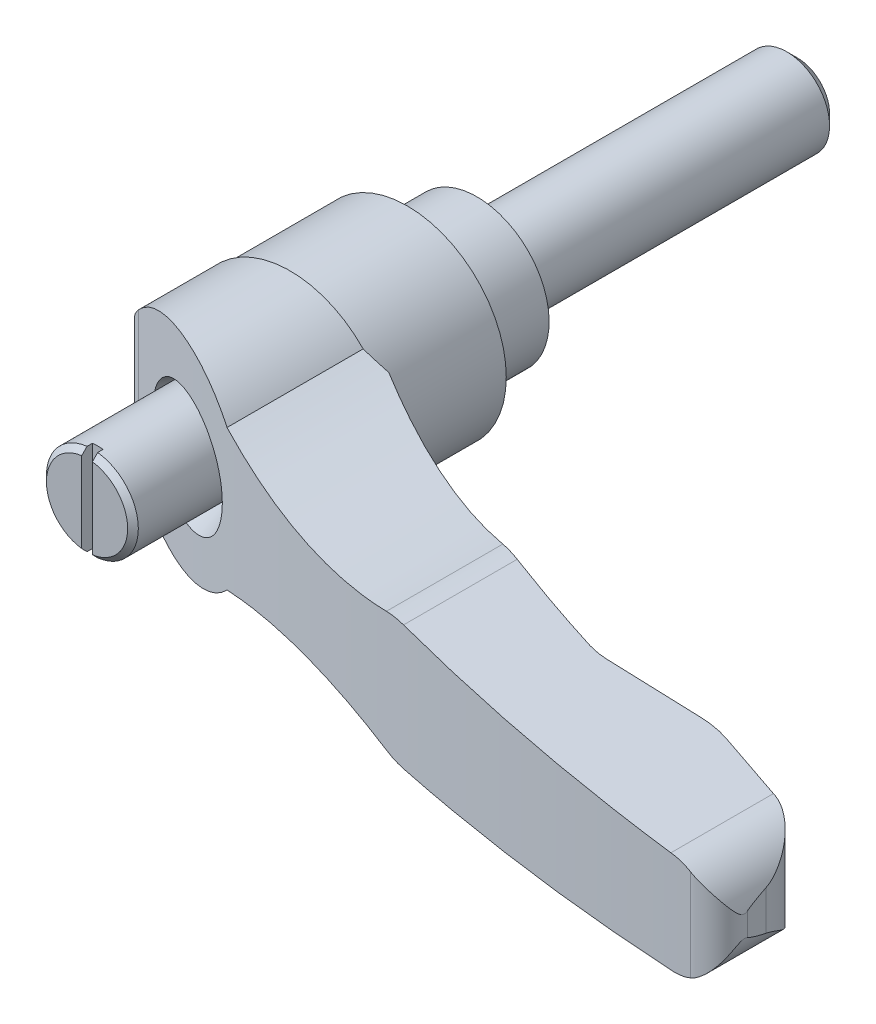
ISO-10303-21;
HEADER;
FILE_DESCRIPTION(('STEP AP214'),'2;1');
FILE_NAME('part.step','',(''),(''),'','','');
FILE_SCHEMA(('AUTOMOTIVE_DESIGN { 1 0 10303 214 1 1 1 1 }'));
ENDSEC;
DATA;
#1=APPLICATION_CONTEXT('core data for automotive mechanical design processes');
#2=APPLICATION_PROTOCOL_DEFINITION('international standard','automotive_design',2000,#1);
#3=PRODUCT_CONTEXT('',#1,'mechanical');
#4=PRODUCT('Part','Part','',(#3));
#5=PRODUCT_RELATED_PRODUCT_CATEGORY('part','',(#4));
#6=PRODUCT_DEFINITION_FORMATION('','',#4);
#7=PRODUCT_DEFINITION_CONTEXT('part definition',#1,'design');
#8=PRODUCT_DEFINITION('design','',#6,#7);
#9=PRODUCT_DEFINITION_SHAPE('','',#8);
#10=(LENGTH_UNIT() NAMED_UNIT(*) SI_UNIT(.MILLI.,.METRE.));
#11=(NAMED_UNIT(*) PLANE_ANGLE_UNIT() SI_UNIT($,.RADIAN.));
#12=(NAMED_UNIT(*) SI_UNIT($,.STERADIAN.) SOLID_ANGLE_UNIT());
#13=UNCERTAINTY_MEASURE_WITH_UNIT(LENGTH_MEASURE(1.E-05),#10,'distance_accuracy_value','');
#14=(GEOMETRIC_REPRESENTATION_CONTEXT(3) GLOBAL_UNCERTAINTY_ASSIGNED_CONTEXT((#13)) GLOBAL_UNIT_ASSIGNED_CONTEXT((#10,
#11,#12)) REPRESENTATION_CONTEXT('',''));
#15=CARTESIAN_POINT('',(0.,0.,0.));
#16=DIRECTION('',(0.,0.,1.));
#17=DIRECTION('',(1.,0.,0.));
#18=AXIS2_PLACEMENT_3D('',#15,#16,#17);
#19=CARTESIAN_POINT('',(-0.010000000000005,0.,20.625));
#20=DIRECTION('',(0.,0.,-1.));
#21=DIRECTION('',(1.,0.,0.));
#22=AXIS2_PLACEMENT_3D('',#19,#20,#21);
#23=CYLINDRICAL_SURFACE('',#22,9.25);
#24=CARTESIAN_POINT('',(-0.0100000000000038,0.,17.5));
#25=DIRECTION('',(0.,0.,1.));
#26=DIRECTION('',(0.,-1.,0.));
#27=AXIS2_PLACEMENT_3D('',#24,#25,#26);
#28=CIRCLE('',#27,9.25);
#29=CARTESIAN_POINT('',(-9.26,0.,17.5));
#30=VERTEX_POINT('',#29);
#31=CARTESIAN_POINT('',(9.24,0.,17.5));
#32=VERTEX_POINT('',#31);
#33=EDGE_CURVE('E242',#30,#32,#28,.T.);
#34=ORIENTED_EDGE('',*,*,#33,.F.);
#35=EDGE_CURVE('E237',#32,#30,#28,.T.);
#36=ORIENTED_EDGE('',*,*,#35,.F.);
#37=EDGE_LOOP('',(#34,#36));
#38=FACE_BOUND('',#37,.T.);
#39=CARTESIAN_POINT('',(-0.00999999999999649,0.,-2.50003775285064));
#40=DIRECTION('',(0.707106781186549,0.,0.707106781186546));
#41=DIRECTION('',(0.707106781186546,0.,-0.707106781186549));
#42=AXIS2_PLACEMENT_3D('',#39,#40,#41);
#43=ELLIPSE('',#42,13.0814754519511,9.25);
#44=CARTESIAN_POINT('',(-9.0100377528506,-2.13584185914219,6.5));
#45=VERTEX_POINT('',#44);
#46=CARTESIAN_POINT('',(-9.0100377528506,2.13584185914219,6.5));
#47=VERTEX_POINT('',#46);
#48=EDGE_CURVE('E515',#45,#47,#43,.F.);
#49=ORIENTED_EDGE('',*,*,#48,.F.);
#50=CARTESIAN_POINT('',(-0.0099999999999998,0.,6.5));
#51=DIRECTION('',(0.,0.,-1.));
#52=DIRECTION('',(1.,0.,0.));
#53=AXIS2_PLACEMENT_3D('',#50,#51,#52);
#54=CIRCLE('',#53,9.25);
#55=EDGE_CURVE('E32',#47,#45,#54,.T.);
#56=ORIENTED_EDGE('',*,*,#55,.F.);
#57=EDGE_LOOP('',(#49,#56));
#58=FACE_BOUND('',#57,.T.);
#59=ADVANCED_FACE('F14',(#38,#58),#23,.T.);
#60=CARTESIAN_POINT('',(-9.26,-19.,6.7499622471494));
#61=DIRECTION('',(0.707106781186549,0.,0.707106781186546));
#62=DIRECTION('',(-0.707106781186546,0.,0.707106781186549));
#63=AXIS2_PLACEMENT_3D('',#60,#61,#62);
#64=PLANE('',#63);
#65=ORIENTED_EDGE('',*,*,#48,.T.);
#66=DIRECTION('',(0.,1.,0.));
#67=VECTOR('',#66,1.);
#68=CARTESIAN_POINT('',(-9.0100377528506,-19.,6.5));
#69=LINE('',#68,#67);
#70=EDGE_CURVE('E85',#45,#47,#69,.T.);
#71=ORIENTED_EDGE('',*,*,#70,.F.);
#72=EDGE_LOOP('',(#65,#71));
#73=FACE_BOUND('',#72,.T.);
#74=ADVANCED_FACE('F497',(#73),#64,.F.);
#75=CARTESIAN_POINT('',(-0.0099999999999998,0.,6.5));
#76=DIRECTION('',(0.,0.,-1.));
#77=DIRECTION('',(1.,0.,0.));
#78=AXIS2_PLACEMENT_3D('',#75,#76,#77);
#79=PLANE('',#78);
#80=CARTESIAN_POINT('',(0.,0.,6.5));
#81=DIRECTION('',(0.,0.,-1.));
#82=DIRECTION('',(1.,0.,0.));
#83=AXIS2_PLACEMENT_3D('',#80,#81,#82);
#84=CIRCLE('',#83,7.);
#85=CARTESIAN_POINT('',(7.,0.,6.5));
#86=VERTEX_POINT('',#85);
#87=EDGE_CURVE('E24',#86,#86,#84,.T.);
#88=ORIENTED_EDGE('',*,*,#87,.F.);
#89=EDGE_LOOP('',(#88));
#90=FACE_BOUND('',#89,.T.);
#91=ORIENTED_EDGE('',*,*,#70,.T.);
#92=ORIENTED_EDGE('',*,*,#55,.T.);
#93=EDGE_LOOP('',(#91,#92));
#94=FACE_BOUND('',#93,.T.);
#95=ADVANCED_FACE('F499',(#90,#94),#79,.T.);
#96=CARTESIAN_POINT('',(0.,0.,6.5));
#97=DIRECTION('',(0.,0.,1.));
#98=DIRECTION('',(0.,-1.,0.));
#99=AXIS2_PLACEMENT_3D('',#96,#97,#98);
#100=CYLINDRICAL_SURFACE('',#99,7.);
#101=ORIENTED_EDGE('',*,*,#87,.T.);
#102=EDGE_LOOP('',(#101));
#103=FACE_BOUND('',#102,.T.);
#104=CARTESIAN_POINT('',(0.,0.,6.9));
#105=DIRECTION('',(0.,0.,1.));
#106=DIRECTION('',(0.,-1.,0.));
#107=AXIS2_PLACEMENT_3D('',#104,#105,#106);
#108=CIRCLE('',#107,7.);
#109=CARTESIAN_POINT('',(0.,-7.,6.9));
#110=VERTEX_POINT('',#109);
#111=EDGE_CURVE('E1131',#110,#110,#108,.T.);
#112=ORIENTED_EDGE('',*,*,#111,.T.);
#113=EDGE_LOOP('',(#112));
#114=FACE_BOUND('',#113,.T.);
#115=ADVANCED_FACE('F501',(#103,#114),#100,.F.);
#116=CARTESIAN_POINT('',(0.,0.,7.15));
#117=DIRECTION('',(0.,0.,-1.));
#118=DIRECTION('',(0.,1.,0.));
#119=AXIS2_PLACEMENT_3D('',#116,#117,#118);
#120=CONICAL_SURFACE('',#119,6.75,0.78539816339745);
#121=ORIENTED_EDGE('',*,*,#111,.F.);
#122=EDGE_LOOP('',(#121));
#123=FACE_BOUND('',#122,.T.);
#124=CARTESIAN_POINT('',(0.,0.,7.15));
#125=DIRECTION('',(0.,0.,1.));
#126=DIRECTION('',(0.,-1.,0.));
#127=AXIS2_PLACEMENT_3D('',#124,#125,#126);
#128=CIRCLE('',#127,6.75);
#129=CARTESIAN_POINT('',(0.,-6.75,7.15));
#130=VERTEX_POINT('',#129);
#131=EDGE_CURVE('E521',#130,#130,#128,.T.);
#132=ORIENTED_EDGE('',*,*,#131,.T.);
#133=EDGE_LOOP('',(#132));
#134=FACE_BOUND('',#133,.T.);
#135=ADVANCED_FACE('F509',(#123,#134),#120,.F.);
#136=CARTESIAN_POINT('',(-9.26,-10.5,17.5));
#137=DIRECTION('',(0.,0.,1.));
#138=DIRECTION('',(0.,-1.,0.));
#139=AXIS2_PLACEMENT_3D('',#136,#137,#138);
#140=PLANE('',#139);
#141=CARTESIAN_POINT('',(19.2499999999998,-44.0899999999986,17.5));
#142=DIRECTION('',(0.,0.,1.));
#143=DIRECTION('',(0.,-1.,0.));
#144=AXIS2_PLACEMENT_3D('',#141,#142,#143);
#145=CIRCLE('',#144,39.4999999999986);
#146=CARTESIAN_POINT('',(6.84374087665,-6.588870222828,17.5));
#147=VERTEX_POINT('',#146);
#148=CARTESIAN_POINT('',(9.24,-5.87940068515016,17.5));
#149=VERTEX_POINT('',#148);
#150=EDGE_CURVE('E585',#147,#149,#145,.F.);
#151=ORIENTED_EDGE('',*,*,#150,.F.);
#152=CARTESIAN_POINT('',(0.,0.,17.5));
#153=DIRECTION('',(0.,0.,1.));
#154=DIRECTION('',(0.,-1.,0.));
#155=AXIS2_PLACEMENT_3D('',#152,#153,#154);
#156=CIRCLE('',#155,9.5);
#157=CARTESIAN_POINT('',(-9.26,-2.12188595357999,17.5));
#158=VERTEX_POINT('',#157);
#159=EDGE_CURVE('E586',#158,#147,#156,.T.);
#160=ORIENTED_EDGE('',*,*,#159,.F.);
#161=DIRECTION('',(0.,1.,0.));
#162=VECTOR('',#161,1.);
#163=CARTESIAN_POINT('',(-9.26,-10.5,17.5));
#164=LINE('',#163,#162);
#165=EDGE_CURVE('E231',#158,#30,#164,.T.);
#166=ORIENTED_EDGE('',*,*,#165,.T.);
#167=ORIENTED_EDGE('',*,*,#33,.T.);
#168=DIRECTION('',(0.,1.,0.));
#169=VECTOR('',#168,1.);
#170=CARTESIAN_POINT('',(9.24,-10.5,17.5));
#171=LINE('',#170,#169);
#172=EDGE_CURVE('E270',#149,#32,#171,.T.);
#173=ORIENTED_EDGE('',*,*,#172,.F.);
#174=EDGE_LOOP('',(#151,#160,#166,#167,#173));
#175=FACE_BOUND('',#174,.T.);
#176=ADVANCED_FACE('F580',(#175),#140,.F.);
#177=CARTESIAN_POINT('',(-9.26,-10.5,21.203824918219));
#178=DIRECTION('',(1.,0.,0.));
#179=DIRECTION('',(0.,1.,0.));
#180=AXIS2_PLACEMENT_3D('',#177,#178,#179);
#181=PLANE('',#180);
#182=DIRECTION('',(0.,0.,1.));
#183=VECTOR('',#182,1.);
#184=CARTESIAN_POINT('',(-9.26,2.12188595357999,0.));
#185=LINE('',#184,#183);
#186=CARTESIAN_POINT('',(-9.26,2.12188595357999,17.5));
#187=VERTEX_POINT('',#186);
#188=CARTESIAN_POINT('',(-9.26,2.12188595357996,21.203824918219));
#189=VERTEX_POINT('',#188);
#190=EDGE_CURVE('E209',#187,#189,#185,.T.);
#191=ORIENTED_EDGE('',*,*,#190,.F.);
#192=EDGE_CURVE('E272',#30,#187,#164,.T.);
#193=ORIENTED_EDGE('',*,*,#192,.F.);
#194=ORIENTED_EDGE('',*,*,#165,.F.);
#195=DIRECTION('',(0.,0.,1.));
#196=VECTOR('',#195,1.);
#197=CARTESIAN_POINT('',(-9.26,-2.12188595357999,0.));
#198=LINE('',#197,#196);
#199=CARTESIAN_POINT('',(-9.26,-2.12188595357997,21.203824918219));
#200=VERTEX_POINT('',#199);
#201=EDGE_CURVE('E236',#200,#158,#198,.F.);
#202=ORIENTED_EDGE('',*,*,#201,.F.);
#203=DIRECTION('',(0.,1.,0.));
#204=VECTOR('',#203,1.);
#205=CARTESIAN_POINT('',(-9.26,-10.5,21.203824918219));
#206=LINE('',#205,#204);
#207=EDGE_CURVE('E227',#200,#189,#206,.T.);
#208=ORIENTED_EDGE('',*,*,#207,.T.);
#209=EDGE_LOOP('',(#191,#193,#194,#202,#208));
#210=FACE_BOUND('',#209,.T.);
#211=ADVANCED_FACE('F234',(#210),#181,.F.);
#212=CARTESIAN_POINT('',(19.2499999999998,44.0899999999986,17.5));
#213=DIRECTION('',(0.,0.,1.));
#214=DIRECTION('',(0.,-1.,0.));
#215=AXIS2_PLACEMENT_3D('',#212,#213,#214);
#216=CIRCLE('',#215,39.4999999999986);
#217=CARTESIAN_POINT('',(9.24,5.87940068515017,17.5));
#218=VERTEX_POINT('',#217);
#219=CARTESIAN_POINT('',(6.84374087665,6.588870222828,17.5));
#220=VERTEX_POINT('',#219);
#221=EDGE_CURVE('E570',#218,#220,#216,.F.);
#222=ORIENTED_EDGE('',*,*,#221,.F.);
#223=EDGE_CURVE('E269',#32,#218,#171,.T.);
#224=ORIENTED_EDGE('',*,*,#223,.F.);
#225=ORIENTED_EDGE('',*,*,#35,.T.);
#226=ORIENTED_EDGE('',*,*,#192,.T.);
#227=CARTESIAN_POINT('',(0.,0.,17.5));
#228=DIRECTION('',(0.,0.,1.));
#229=DIRECTION('',(0.,-1.,0.));
#230=AXIS2_PLACEMENT_3D('',#227,#228,#229);
#231=CIRCLE('',#230,9.5);
#232=EDGE_CURVE('E216',#220,#187,#231,.T.);
#233=ORIENTED_EDGE('',*,*,#232,.F.);
#234=EDGE_LOOP('',(#222,#224,#225,#226,#233));
#235=FACE_BOUND('',#234,.T.);
#236=ADVANCED_FACE('F449',(#235),#140,.F.);
#237=CARTESIAN_POINT('',(42.239481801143,-10.5,23.0800000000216));
#238=DIRECTION('',(0.,1.,0.));
#239=DIRECTION('',(-1.,0.,0.));
#240=AXIS2_PLACEMENT_3D('',#237,#238,#239);
#241=CYLINDRICAL_SURFACE('',#240,6.97999999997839);
#242=CARTESIAN_POINT('',(42.239481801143,5.40097293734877,23.0800000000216));
#243=DIRECTION('',(0.036120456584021,0.999347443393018,0.));
#244=DIRECTION('',(-0.999347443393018,0.036120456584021,0.));
#245=AXIS2_PLACEMENT_3D('',#242,#243,#244);
#246=ELLIPSE('',#245,6.98455781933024,6.97999999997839);
#247=CARTESIAN_POINT('',(42.239481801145,5.4009729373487,30.06));
#248=VERTEX_POINT('',#247);
#249=CARTESIAN_POINT('',(40.302460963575,5.47098470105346,29.785844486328));
#250=VERTEX_POINT('',#249);
#251=EDGE_CURVE('E1218',#248,#250,#246,.F.);
#252=ORIENTED_EDGE('',*,*,#251,.F.);
#253=DIRECTION('',(0.,1.,0.));
#254=VECTOR('',#253,1.);
#255=CARTESIAN_POINT('',(42.239481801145,-10.5,30.06));
#256=LINE('',#255,#254);
#257=CARTESIAN_POINT('',(42.239481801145,-5.4009729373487,30.06));
#258=VERTEX_POINT('',#257);
#259=EDGE_CURVE('E263',#258,#248,#256,.T.);
#260=ORIENTED_EDGE('',*,*,#259,.F.);
#261=CARTESIAN_POINT('',(42.239481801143,-5.40097293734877,23.0800000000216));
#262=DIRECTION('',(0.036120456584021,-0.999347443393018,0.));
#263=DIRECTION('',(0.999347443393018,0.036120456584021,0.));
#264=AXIS2_PLACEMENT_3D('',#261,#262,#263);
#265=ELLIPSE('',#264,6.98455781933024,6.97999999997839);
#266=CARTESIAN_POINT('',(40.302460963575,-5.47098470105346,29.785844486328));
#267=VERTEX_POINT('',#266);
#268=EDGE_CURVE('E603',#267,#258,#265,.F.);
#269=ORIENTED_EDGE('',*,*,#268,.F.);
#270=DIRECTION('',(0.,1.,0.));
#271=VECTOR('',#270,1.);
#272=CARTESIAN_POINT('',(40.302460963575,-10.5,29.785844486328));
#273=LINE('',#272,#271);
#274=EDGE_CURVE('E266',#267,#250,#273,.T.);
#275=ORIENTED_EDGE('',*,*,#274,.T.);
#276=EDGE_LOOP('',(#252,#260,#269,#275));
#277=FACE_BOUND('',#276,.T.);
#278=ADVANCED_FACE('F445',(#277),#241,.F.);
#279=CARTESIAN_POINT('',(42.239481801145,-10.5,30.06));
#280=DIRECTION('',(0.,0.,1.));
#281=DIRECTION('',(0.,-1.,0.));
#282=AXIS2_PLACEMENT_3D('',#279,#280,#281);
#283=PLANE('',#282);
#284=DIRECTION('',(-0.999347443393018,0.036120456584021,0.));
#285=VECTOR('',#284,1.);
#286=CARTESIAN_POINT('',(42.8134574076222,5.38022713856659,30.06));
#287=LINE('',#286,#285);
#288=CARTESIAN_POINT('',(51.078035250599,5.08151188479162,30.06));
#289=VERTEX_POINT('',#288);
#290=EDGE_CURVE('E1217',#289,#248,#287,.T.);
#291=ORIENTED_EDGE('',*,*,#290,.F.);
#292=DIRECTION('',(0.,1.,0.));
#293=VECTOR('',#292,1.);
#294=CARTESIAN_POINT('',(51.078035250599,-10.5,30.06));
#295=LINE('',#294,#293);
#296=CARTESIAN_POINT('',(51.078035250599,-5.08151188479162,30.06));
#297=VERTEX_POINT('',#296);
#298=EDGE_CURVE('E260',#297,#289,#295,.T.);
#299=ORIENTED_EDGE('',*,*,#298,.F.);
#300=DIRECTION('',(0.999347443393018,0.036120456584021,0.));
#301=VECTOR('',#300,1.);
#302=CARTESIAN_POINT('',(42.0554228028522,-5.40762557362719,30.06));
#303=LINE('',#302,#301);
#304=EDGE_CURVE('E605',#258,#297,#303,.T.);
#305=ORIENTED_EDGE('',*,*,#304,.F.);
#306=ORIENTED_EDGE('',*,*,#259,.T.);
#307=EDGE_LOOP('',(#291,#299,#305,#306));
#308=FACE_BOUND('',#307,.T.);
#309=ADVANCED_FACE('F441',(#308),#283,.F.);
#310=CARTESIAN_POINT('',(51.0780352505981,-10.5,39.2200000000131));
#311=DIRECTION('',(0.,1.,0.));
#312=DIRECTION('',(-1.,0.,0.));
#313=AXIS2_PLACEMENT_3D('',#310,#311,#312);
#314=CYLINDRICAL_SURFACE('',#313,9.16000000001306);
#315=CARTESIAN_POINT('',(51.0780352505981,5.08151188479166,39.2200000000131));
#316=DIRECTION('',(0.036120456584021,0.999347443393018,0.));
#317=DIRECTION('',(-0.999347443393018,0.036120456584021,0.));
#318=AXIS2_PLACEMENT_3D('',#315,#316,#317);
#319=ELLIPSE('',#318,9.165981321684,9.16000000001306);
#320=CARTESIAN_POINT('',(53.829450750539,4.98206460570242,30.482991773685));
#321=VERTEX_POINT('',#320);
#322=EDGE_CURVE('E618',#321,#289,#319,.T.);
#323=ORIENTED_EDGE('',*,*,#322,.F.);
#324=DIRECTION('',(0.,1.,0.));
#325=VECTOR('',#324,1.);
#326=CARTESIAN_POINT('',(53.829450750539,-10.5,30.482991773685));
#327=LINE('',#326,#325);
#328=CARTESIAN_POINT('',(53.829450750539,-4.98206460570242,30.482991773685));
#329=VERTEX_POINT('',#328);
#330=EDGE_CURVE('E257',#329,#321,#327,.T.);
#331=ORIENTED_EDGE('',*,*,#330,.F.);
#332=CARTESIAN_POINT('',(51.0780352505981,-5.08151188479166,39.2200000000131));
#333=DIRECTION('',(0.036120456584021,-0.999347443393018,0.));
#334=DIRECTION('',(0.999347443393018,0.036120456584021,0.));
#335=AXIS2_PLACEMENT_3D('',#332,#333,#334);
#336=ELLIPSE('',#335,9.165981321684,9.16000000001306);
#337=EDGE_CURVE('E609',#297,#329,#336,.T.);
#338=ORIENTED_EDGE('',*,*,#337,.F.);
#339=ORIENTED_EDGE('',*,*,#298,.T.);
#340=EDGE_LOOP('',(#323,#331,#338,#339));
#341=FACE_BOUND('',#340,.T.);
#342=ADVANCED_FACE('F438',(#341),#314,.T.);
#343=CARTESIAN_POINT('',(88.9416647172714,-10.5,-138.600024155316));
#344=DIRECTION('',(0.,1.,0.));
#345=DIRECTION('',(-1.,0.,0.));
#346=AXIS2_PLACEMENT_3D('',#343,#344,#345);
#347=CYLINDRICAL_SURFACE('',#346,175.269999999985);
#348=CARTESIAN_POINT('',(28.237973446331,-5.6261685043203,25.8220995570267));
#349=CARTESIAN_POINT('',(28.4107669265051,-5.66655022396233,25.8858955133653));
#350=CARTESIAN_POINT('',(28.5848476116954,-5.70116065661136,25.9498539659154));
#351=CARTESIAN_POINT('',(28.9342210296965,-5.75862584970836,26.0775818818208));
#352=CARTESIAN_POINT('',(29.1095064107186,-5.78152582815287,26.1413511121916));
#353=CARTESIAN_POINT('',(29.4612825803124,-5.81567270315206,26.2686873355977));
#354=CARTESIAN_POINT('',(29.6377733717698,-5.82691957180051,26.3322543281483));
#355=CARTESIAN_POINT('',(29.9919650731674,-5.83772087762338,26.4591818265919));
#356=CARTESIAN_POINT('',(30.1696680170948,-5.83722946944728,26.5225405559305));
#357=CARTESIAN_POINT('',(30.347286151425,-5.8308049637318,26.5855433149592));
#358=B_SPLINE_CURVE_WITH_KNOTS('',3,(#348,#349,#350,#351,#352,#353,#354,#355,#356,#357),
.UNSPECIFIED.,.F.,.F.,(4,2,2,2,4),(0.,0.565611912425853,1.12902299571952,1.692435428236,
2.25804869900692),.UNSPECIFIED.);
#359=CARTESIAN_POINT('',(28.237973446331,-5.6261685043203,25.8220995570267));
#360=VERTEX_POINT('',#359);
#361=CARTESIAN_POINT('',(30.347286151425,-5.8308049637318,26.5855433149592));
#362=VERTEX_POINT('',#361);
#363=EDGE_CURVE('E469',#360,#362,#358,.T.);
#364=ORIENTED_EDGE('',*,*,#363,.F.);
#365=CARTESIAN_POINT('',(9.24,-5.87940068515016,17.5));
#366=CARTESIAN_POINT('',(9.79948003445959,-5.73283344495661,17.7856672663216));
#367=CARTESIAN_POINT('',(10.3630165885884,-5.59833643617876,18.0695987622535));
#368=CARTESIAN_POINT('',(11.4974282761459,-5.35391463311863,18.633444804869));
#369=CARTESIAN_POINT('',(12.0683039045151,-5.24399150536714,18.913359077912));
#370=CARTESIAN_POINT('',(13.2171050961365,-5.04907387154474,19.4688580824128));
#371=CARTESIAN_POINT('',(13.7950370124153,-4.9641038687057,19.7444383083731));
#372=CARTESIAN_POINT('',(14.9564491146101,-4.81968144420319,20.2904183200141));
#373=CARTESIAN_POINT('',(15.5399291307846,-4.7602282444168,20.5608182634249));
#374=CARTESIAN_POINT('',(17.274544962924,-4.62260622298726,21.3530632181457));
#375=CARTESIAN_POINT('',(18.4324989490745,-4.58133087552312,21.8669029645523));
#376=CARTESIAN_POINT('',(20.7578250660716,-4.6016852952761,22.8686662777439));
#377=CARTESIAN_POINT('',(21.9251896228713,-4.66323920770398,23.3566086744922));
#378=CARTESIAN_POINT('',(23.5210667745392,-4.81923174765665,24.0035807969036));
#379=CARTESIAN_POINT('',(23.9492706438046,-4.86815262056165,24.1752006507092));
#380=CARTESIAN_POINT('',(24.8053598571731,-4.98022826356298,24.5144113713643));
#381=CARTESIAN_POINT('',(25.2332452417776,-5.04338071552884,24.6820028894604));
#382=CARTESIAN_POINT('',(26.0913487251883,-5.18451989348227,25.0142291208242));
#383=CARTESIAN_POINT('',(26.5215613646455,-5.26261041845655,25.1788337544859));
#384=CARTESIAN_POINT('',(27.3808012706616,-5.43340913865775,25.5037363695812));
#385=CARTESIAN_POINT('',(27.8098283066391,-5.5261199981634,25.6640335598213));
#386=CARTESIAN_POINT('',(28.237973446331,-5.62616850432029,25.8220995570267));
#387=B_SPLINE_CURVE_WITH_KNOTS('',3,(#365,#366,#367,#368,#369,#370,#371,#372,#373,#374,#375,
#376,#377,#378,#379,#380,#381,#382,#383,#384,#385,#386),.UNSPECIFIED.,.F.,.F.,(4,2,2,2,2,2,2,2,
2,2,4),(0.,1.93506781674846,3.87026682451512,5.80735983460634,7.74439376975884,11.5423680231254,
15.337541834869,16.7290778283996,18.120387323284,19.5217408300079,20.9233500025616),.UNSPECIFIED.);
#388=EDGE_CURVE('E459',#149,#360,#387,.T.);
#389=ORIENTED_EDGE('',*,*,#388,.F.);
#390=ORIENTED_EDGE('',*,*,#172,.T.);
#391=ORIENTED_EDGE('',*,*,#223,.T.);
#392=CARTESIAN_POINT('',(28.237973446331,5.62616850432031,25.8220995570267));
#393=CARTESIAN_POINT('',(27.6467124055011,5.48799745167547,25.6038196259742));
#394=CARTESIAN_POINT('',(27.053777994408,5.36383084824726,25.3812778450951));
#395=CARTESIAN_POINT('',(25.8659006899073,5.14331117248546,24.9280288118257));
#396=CARTESIAN_POINT('',(25.2709579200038,5.0469564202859,24.6973220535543));
#397=CARTESIAN_POINT('',(24.0803912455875,4.88185687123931,24.2280988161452));
#398=CARTESIAN_POINT('',(23.4847674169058,4.81310925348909,23.9895831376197));
#399=CARTESIAN_POINT('',(22.2940534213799,4.70292970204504,23.5051335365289));
#400=CARTESIAN_POINT('',(21.6989632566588,4.66149787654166,23.2591995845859));
#401=CARTESIAN_POINT('',(19.9382363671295,4.57874286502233,22.5201121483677));
#402=CARTESIAN_POINT('',(18.7748149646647,4.57591682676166,22.0168726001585));
#403=CARTESIAN_POINT('',(16.4631439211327,4.67145944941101,20.9870607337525));
#404=CARTESIAN_POINT('',(15.3148886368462,4.76978933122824,20.4604974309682));
#405=CARTESIAN_POINT('',(13.7610005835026,4.97097993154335,19.7276539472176));
#406=CARTESIAN_POINT('',(13.34559469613,5.03153416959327,19.5297267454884));
#407=CARTESIAN_POINT('',(12.5181281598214,5.16561835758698,19.1314774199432));
#408=CARTESIAN_POINT('',(12.1060667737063,5.23914536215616,18.9311558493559));
#409=CARTESIAN_POINT('',(11.2826997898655,5.39957122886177,18.5268986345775));
#410=CARTESIAN_POINT('',(10.8714191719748,5.48655913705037,18.3229475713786));
#411=CARTESIAN_POINT('',(10.052717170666,5.67338492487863,17.9129677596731));
#412=CARTESIAN_POINT('',(9.64529662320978,5.77322552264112,17.7069385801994));
#413=CARTESIAN_POINT('',(9.24,5.87940068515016,17.5));
#414=B_SPLINE_CURVE_WITH_KNOTS('',3,(#392,#393,#394,#395,#396,#397,#398,#399,#400,#401,#402,
#403,#404,#405,#406,#407,#408,#409,#410,#411,#412,#413),.UNSPECIFIED.,.F.,.F.,(4,2,2,2,2,2,2,2,
2,2,4),(0.,1.93549726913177,3.87087760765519,5.8060601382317,7.74125033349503,11.5393004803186,
15.3358951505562,16.7281050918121,18.1199993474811,19.5215293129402,20.9233561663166),.UNSPECIFIED.);
#415=CARTESIAN_POINT('',(28.237973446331,5.6261685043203,25.8220995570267));
#416=VERTEX_POINT('',#415);
#417=EDGE_CURVE('E482',#416,#218,#414,.T.);
#418=ORIENTED_EDGE('',*,*,#417,.F.);
#419=CARTESIAN_POINT('',(30.347286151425,5.8308049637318,26.5855433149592));
#420=CARTESIAN_POINT('',(30.1696680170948,5.83722946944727,26.5225405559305));
#421=CARTESIAN_POINT('',(29.9919650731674,5.83772087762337,26.4591818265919));
#422=CARTESIAN_POINT('',(29.6377733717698,5.82691957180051,26.3322543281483));
#423=CARTESIAN_POINT('',(29.4612825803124,5.81567270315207,26.2686873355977));
#424=CARTESIAN_POINT('',(29.1095064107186,5.78152582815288,26.1413511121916));
#425=CARTESIAN_POINT('',(28.9342210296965,5.75862584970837,26.0775818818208));
#426=CARTESIAN_POINT('',(28.5848476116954,5.70116065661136,25.9498539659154));
#427=CARTESIAN_POINT('',(28.4107669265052,5.66655022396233,25.8858955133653));
#428=CARTESIAN_POINT('',(28.237973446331,5.6261685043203,25.8220995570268));
#429=B_SPLINE_CURVE_WITH_KNOTS('',3,(#419,#420,#421,#422,#423,#424,#425,#426,#427,#428),
.UNSPECIFIED.,.F.,.F.,(4,2,2,2,4),(0.,0.56561327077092,1.12902570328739,1.69243678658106,
2.25804869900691),.UNSPECIFIED.);
#430=CARTESIAN_POINT('',(30.347286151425,5.8308049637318,26.5855433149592));
#431=VERTEX_POINT('',#430);
#432=EDGE_CURVE('E476',#431,#416,#429,.T.);
#433=ORIENTED_EDGE('',*,*,#432,.F.);
#434=CARTESIAN_POINT('',(88.9416647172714,3.71296724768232,-138.600024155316));
#435=DIRECTION('',(0.036120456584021,0.999347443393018,0.));
#436=DIRECTION('',(-0.999347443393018,0.036120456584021,0.));
#437=AXIS2_PLACEMENT_3D('',#434,#435,#436);
#438=ELLIPSE('',#437,175.384448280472,175.269999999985);
#439=EDGE_CURVE('E483',#250,#431,#438,.F.);
#440=ORIENTED_EDGE('',*,*,#439,.F.);
#441=ORIENTED_EDGE('',*,*,#274,.F.);
#442=CARTESIAN_POINT('',(88.9416647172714,-3.71296724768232,-138.600024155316));
#443=DIRECTION('',(0.036120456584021,-0.999347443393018,0.));
#444=DIRECTION('',(0.999347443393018,0.036120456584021,0.));
#445=AXIS2_PLACEMENT_3D('',#442,#443,#444);
#446=ELLIPSE('',#445,175.384448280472,175.269999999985);
#447=EDGE_CURVE('E600',#362,#267,#446,.F.);
#448=ORIENTED_EDGE('',*,*,#447,.F.);
#449=EDGE_LOOP('',(#364,#389,#390,#391,#418,#433,#440,#441,#448));
#450=FACE_BOUND('',#449,.T.);
#451=ADVANCED_FACE('F431',(#450),#347,.F.);
#452=CARTESIAN_POINT('',(58.6337202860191,-10.5,38.3283479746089));
#453=DIRECTION('',(0.,1.,0.));
#454=DIRECTION('',(-1.,0.,0.));
#455=AXIS2_PLACEMENT_3D('',#452,#453,#454);
#456=CYLINDRICAL_SURFACE('',#455,6.04000000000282);
#457=CARTESIAN_POINT('',(60.447972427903,-4.74587261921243,32.567263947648));
#458=CARTESIAN_POINT('',(60.5755504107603,-4.74057354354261,32.6074069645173));
#459=CARTESIAN_POINT('',(60.7015088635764,-4.73014540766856,32.6517620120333));
#460=CARTESIAN_POINT('',(60.9490652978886,-4.69992242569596,32.7481786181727));
#461=CARTESIAN_POINT('',(61.0706698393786,-4.68014236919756,32.8002279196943));
#462=CARTESIAN_POINT('',(61.3074659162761,-4.63235500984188,32.9108206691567));
#463=CARTESIAN_POINT('',(61.4227141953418,-4.6044427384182,32.9692844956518));
#464=CARTESIAN_POINT('',(61.647717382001,-4.54120548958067,33.0925213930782));
#465=CARTESIAN_POINT('',(61.7574696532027,-4.50587699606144,33.1572974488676));
#466=CARTESIAN_POINT('',(61.9940137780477,-4.42040174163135,33.3070323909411));
#467=CARTESIAN_POINT('',(62.119393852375,-4.36870213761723,33.3933358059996));
#468=CARTESIAN_POINT('',(62.3610721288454,-4.25718277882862,33.5732278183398));
#469=CARTESIAN_POINT('',(62.4773638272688,-4.19735729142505,33.666821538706));
#470=CARTESIAN_POINT('',(62.7012840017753,-4.07066877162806,33.8608437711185));
#471=CARTESIAN_POINT('',(62.8088611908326,-4.00376876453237,33.9613071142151));
#472=CARTESIAN_POINT('',(63.0146476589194,-3.86453813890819,34.1677809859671));
#473=CARTESIAN_POINT('',(63.1128596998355,-3.79220913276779,34.2737898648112));
#474=CARTESIAN_POINT('',(63.3331746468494,-3.61700510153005,34.5290929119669));
#475=CARTESIAN_POINT('',(63.4514763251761,-3.51235864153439,34.6804594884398));
#476=CARTESIAN_POINT('',(63.6718053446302,-3.29808480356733,34.9913387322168));
#477=CARTESIAN_POINT('',(63.7738256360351,-3.1884552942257,35.1508548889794));
#478=CARTESIAN_POINT('',(63.9616621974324,-2.96765680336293,35.4770445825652));
#479=CARTESIAN_POINT('',(64.047537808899,-2.85649513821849,35.6436890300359));
#480=CARTESIAN_POINT('',(64.2038484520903,-2.63586419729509,35.9851508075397));
#481=CARTESIAN_POINT('',(64.2742871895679,-2.52639452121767,36.1599661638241));
#482=CARTESIAN_POINT('',(64.3705847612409,-2.36382517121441,36.4361542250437));
#483=CARTESIAN_POINT('',(64.4019853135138,-2.30809068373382,36.5340606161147));
#484=CARTESIAN_POINT('',(64.4601539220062,-2.20019362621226,36.7330390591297));
#485=CARTESIAN_POINT('',(64.4869269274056,-2.14802727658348,36.8341075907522));
#486=CARTESIAN_POINT('',(64.5357331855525,-2.04890785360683,37.0402846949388));
#487=CARTESIAN_POINT('',(64.5577546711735,-2.00196785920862,37.1454025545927));
#488=CARTESIAN_POINT('',(64.5966140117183,-1.91618262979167,37.360168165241));
#489=CARTESIAN_POINT('',(64.6134353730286,-1.87736327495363,37.4698291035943));
#490=CARTESIAN_POINT('',(64.62740519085,-1.84413226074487,37.581795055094));
#491=B_SPLINE_CURVE_WITH_KNOTS('',3,(#457,#458,#459,#460,#461,#462,#463,#464,#465,#466,#467,
#468,#469,#470,#471,#472,#473,#474,#475,#476,#477,#478,#479,#480,#481,#482,#483,#484,#485,#486,
#487,#488,#489,#490),.UNSPECIFIED.,.F.,.F.,(4,2,2,2,2,2,2,2,2,2,2,2,2,2,2,2,4),(0.,
0.401264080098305,0.801895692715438,1.19802151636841,1.5943355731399,2.07588331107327,
2.55777255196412,3.04231807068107,3.52672024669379,4.18208013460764,4.83772302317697,
5.49090678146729,6.14393356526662,6.49464389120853,6.84497677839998,7.19616755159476,
7.54846105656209),.UNSPECIFIED.);
#492=CARTESIAN_POINT('',(60.447972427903,-4.74587261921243,32.567263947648));
#493=VERTEX_POINT('',#492);
#494=CARTESIAN_POINT('',(64.62740519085,-1.84413226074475,37.581795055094));
#495=VERTEX_POINT('',#494);
#496=EDGE_CURVE('E417',#493,#495,#491,.T.);
#497=ORIENTED_EDGE('',*,*,#496,.F.);
#498=DIRECTION('',(0.,1.,0.));
#499=VECTOR('',#498,1.);
#500=CARTESIAN_POINT('',(60.447972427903,-10.5,32.567263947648));
#501=LINE('',#500,#499);
#502=CARTESIAN_POINT('',(60.447972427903,4.74587261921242,32.567263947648));
#503=VERTEX_POINT('',#502);
#504=EDGE_CURVE('E254',#493,#503,#501,.T.);
#505=ORIENTED_EDGE('',*,*,#504,.T.);
#506=CARTESIAN_POINT('',(64.62740519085,1.84413226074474,37.581795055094));
#507=CARTESIAN_POINT('',(64.617586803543,1.86745330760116,37.5030045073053));
#508=CARTESIAN_POINT('',(64.6063375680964,1.89362327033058,37.4253204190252));
#509=CARTESIAN_POINT('',(64.5811702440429,1.95049016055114,37.2721928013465));
#510=CARTESIAN_POINT('',(64.5672561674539,1.98118026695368,37.1967460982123));
#511=CARTESIAN_POINT('',(64.5369883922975,2.0458503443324,37.0482136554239));
#512=CARTESIAN_POINT('',(64.520645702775,2.07981523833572,36.9751189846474));
#513=CARTESIAN_POINT('',(64.4855821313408,2.15032519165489,36.830739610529));
#514=CARTESIAN_POINT('',(64.4668602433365,2.18687133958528,36.75945568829));
#515=CARTESIAN_POINT('',(64.4072221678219,2.29938724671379,36.5479610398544));
#516=CARTESIAN_POINT('',(64.3628565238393,2.3781837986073,36.4102182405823));
#517=CARTESIAN_POINT('',(64.2652007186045,2.53960895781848,36.1400450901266));
#518=CARTESIAN_POINT('',(64.2118976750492,2.6222429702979,36.0076227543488));
#519=CARTESIAN_POINT('',(64.0771192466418,2.8167231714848,35.7040219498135));
#520=CARTESIAN_POINT('',(63.9921849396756,2.92909268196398,35.5347005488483));
#521=CARTESIAN_POINT('',(63.8063278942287,3.15216626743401,35.2039790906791));
#522=CARTESIAN_POINT('',(63.7054078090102,3.26287061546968,35.0425777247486));
#523=CARTESIAN_POINT('',(63.4870671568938,3.47959027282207,34.7278934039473));
#524=CARTESIAN_POINT('',(63.3696459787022,3.58560540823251,34.5746107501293));
#525=CARTESIAN_POINT('',(63.1179209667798,3.78996521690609,34.2772360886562));
#526=CARTESIAN_POINT('',(62.9836257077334,3.88831374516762,34.1331394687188));
#527=CARTESIAN_POINT('',(62.6561598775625,4.10136712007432,33.8153134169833));
#528=CARTESIAN_POINT('',(62.457188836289,4.21258905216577,33.6450495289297));
#529=CARTESIAN_POINT('',(62.1378586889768,4.36029911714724,33.406945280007));
#530=CARTESIAN_POINT('',(62.0281124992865,4.40629516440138,33.3305585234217));
#531=CARTESIAN_POINT('',(61.8018114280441,4.49098569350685,33.1841350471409));
#532=CARTESIAN_POINT('',(61.6852609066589,4.5296847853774,33.1140943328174));
#533=CARTESIAN_POINT('',(61.4786111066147,4.58924867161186,32.9993621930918));
#534=CARTESIAN_POINT('',(61.3900115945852,4.61209493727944,32.9529824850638));
#535=CARTESIAN_POINT('',(61.2097340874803,4.65295056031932,32.864298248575));
#536=CARTESIAN_POINT('',(61.1180570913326,4.67096147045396,32.8219924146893));
#537=CARTESIAN_POINT('',(60.9313596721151,4.70183469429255,32.7415027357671));
#538=CARTESIAN_POINT('',(60.8363219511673,4.71466416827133,32.7033462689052));
#539=CARTESIAN_POINT('',(60.643828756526,4.73463763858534,32.6317122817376));
#540=CARTESIAN_POINT('',(60.5463713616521,4.74177695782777,32.5982386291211));
#541=CARTESIAN_POINT('',(60.447972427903,4.74587261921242,32.567263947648));
#542=B_SPLINE_CURVE_WITH_KNOTS('',3,(#506,#507,#508,#509,#510,#511,#512,#513,#514,#515,#516,
#517,#518,#519,#520,#521,#522,#523,#524,#525,#526,#527,#528,#529,#530,#531,#532,#533,#534,#535,
#536,#537,#538,#539,#540,#541),.UNSPECIFIED.,.F.,.F.,(4,2,2,2,2,2,2,2,2,2,2,2,2,2,2,2,2,4),(0.,
0.248076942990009,0.495783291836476,0.742399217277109,0.98911977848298,1.48293160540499,
1.97746142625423,2.63745339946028,3.29733594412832,3.95724294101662,4.61681594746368,
5.46693586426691,5.89075482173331,6.31430511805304,6.62183365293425,6.92926331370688,
7.23861197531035,7.54821464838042),.UNSPECIFIED.);
#543=CARTESIAN_POINT('',(64.62740519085,1.84413226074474,37.581795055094));
#544=VERTEX_POINT('',#543);
#545=EDGE_CURVE('E402',#544,#503,#542,.T.);
#546=ORIENTED_EDGE('',*,*,#545,.F.);
#547=DIRECTION('',(0.,1.,0.));
#548=VECTOR('',#547,1.);
#549=CARTESIAN_POINT('',(64.62740519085,-10.5,37.581795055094));
#550=LINE('',#549,#548);
#551=EDGE_CURVE('E251',#495,#544,#550,.T.);
#552=ORIENTED_EDGE('',*,*,#551,.F.);
#553=EDGE_LOOP('',(#497,#505,#546,#552));
#554=FACE_BOUND('',#553,.T.);
#555=ADVANCED_FACE('F426',(#554),#456,.T.);
#556=CARTESIAN_POINT('',(64.62740519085,-10.5,37.581795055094));
#557=DIRECTION('',(-0.992331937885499,0.,0.123601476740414));
#558=DIRECTION('',(-0.123601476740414,0.,-0.992331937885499));
#559=AXIS2_PLACEMENT_3D('',#556,#557,#558);
#560=PLANE('',#559);
#561=CARTESIAN_POINT('',(60.25,0.,2.43788666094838));
#562=DIRECTION('',(-0.992331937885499,0.,0.123601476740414));
#563=DIRECTION('',(0.123601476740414,0.,0.992331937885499));
#564=AXIS2_PLACEMENT_3D('',#561,#562,#563);
#565=ELLIPSE('',#564,38.429961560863,4.75);
#566=CARTESIAN_POINT('',(64.874540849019,1.08449155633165,39.565918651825));
#567=VERTEX_POINT('',#566);
#568=EDGE_CURVE('E604',#567,#544,#565,.T.);
#569=ORIENTED_EDGE('',*,*,#568,.F.);
#570=DIRECTION('',(0.,1.,0.));
#571=VECTOR('',#570,1.);
#572=CARTESIAN_POINT('',(64.874540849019,-10.5,39.565918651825));
#573=LINE('',#572,#571);
#574=CARTESIAN_POINT('',(64.874540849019,-1.08449155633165,39.565918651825));
#575=VERTEX_POINT('',#574);
#576=EDGE_CURVE('E248',#575,#567,#573,.T.);
#577=ORIENTED_EDGE('',*,*,#576,.F.);
#578=EDGE_CURVE('E415',#495,#575,#565,.T.);
#579=ORIENTED_EDGE('',*,*,#578,.F.);
#580=ORIENTED_EDGE('',*,*,#551,.T.);
#581=EDGE_LOOP('',(#569,#577,#579,#580));
#582=FACE_BOUND('',#581,.T.);
#583=ADVANCED_FACE('F430',(#582),#560,.F.);
#584=CARTESIAN_POINT('',(53.829450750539,-10.5,30.482991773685));
#585=DIRECTION('',(-0.300372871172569,0.,0.95382185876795));
#586=DIRECTION('',(-0.95382185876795,0.,-0.300372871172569));
#587=AXIS2_PLACEMENT_3D('',#584,#585,#586);
#588=PLANE('',#587);
#589=DIRECTION('',(-0.953255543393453,0.0344545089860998,-0.300194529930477));
#590=VECTOR('',#589,1.);
#591=CARTESIAN_POINT('',(54.3379429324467,4.96368564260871,30.6431236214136));
#592=LINE('',#591,#590);
#593=CARTESIAN_POINT('',(60.25,4.75,32.5049194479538));
#594=VERTEX_POINT('',#593);
#595=EDGE_CURVE('E424',#594,#321,#592,.T.);
#596=ORIENTED_EDGE('',*,*,#595,.F.);
#597=CARTESIAN_POINT('',(60.25,0.,32.5049194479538));
#598=DIRECTION('',(-0.300372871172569,0.,0.95382185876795));
#599=DIRECTION('',(0.95382185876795,0.,0.300372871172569));
#600=AXIS2_PLACEMENT_3D('',#597,#598,#599);
#601=ELLIPSE('',#600,4.97996555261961,4.75);
#602=EDGE_CURVE('E416',#503,#594,#601,.T.);
#603=ORIENTED_EDGE('',*,*,#602,.F.);
#604=ORIENTED_EDGE('',*,*,#504,.F.);
#605=CARTESIAN_POINT('',(60.25,-4.75,32.5049194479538));
#606=VERTEX_POINT('',#605);
#607=EDGE_CURVE('E423',#606,#493,#601,.T.);
#608=ORIENTED_EDGE('',*,*,#607,.F.);
#609=DIRECTION('',(0.953255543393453,0.0344545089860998,0.300194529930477));
#610=VECTOR('',#609,1.);
#611=CARTESIAN_POINT('',(53.6482199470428,-4.98861501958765,30.4259194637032));
#612=LINE('',#611,#610);
#613=EDGE_CURVE('E599',#329,#606,#612,.T.);
#614=ORIENTED_EDGE('',*,*,#613,.F.);
#615=ORIENTED_EDGE('',*,*,#330,.T.);
#616=EDGE_LOOP('',(#596,#603,#604,#608,#614,#615));
#617=FACE_BOUND('',#616,.T.);
#618=ADVANCED_FACE('F433',(#617),#588,.F.);
#619=CARTESIAN_POINT('',(62.4730975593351,-10.5,39.8650342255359));
#620=DIRECTION('',(0.,1.,0.));
#621=DIRECTION('',(-1.,0.,0.));
#622=AXIS2_PLACEMENT_3D('',#619,#620,#621);
#623=CYLINDRICAL_SURFACE('',#622,2.42000000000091);
#624=CARTESIAN_POINT('',(64.874540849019,-1.08449155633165,39.565918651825));
#625=CARTESIAN_POINT('',(64.8785986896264,-1.06718866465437,39.5983671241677));
#626=CARTESIAN_POINT('',(64.8821274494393,-1.05169442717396,39.6321861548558));
#627=CARTESIAN_POINT('',(64.887857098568,-1.02613774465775,39.7020851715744));
#628=CARTESIAN_POINT('',(64.8900508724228,-1.01610443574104,39.7381761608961));
#629=CARTESIAN_POINT('',(64.8925173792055,-1.00476860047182,39.8044107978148));
#630=CARTESIAN_POINT('',(64.8930868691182,-1.00211989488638,39.8342978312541));
#631=CARTESIAN_POINT('',(64.893107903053,-1.00202247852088,39.8939346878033));
#632=CARTESIAN_POINT('',(64.8925646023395,-1.00454978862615,39.9236845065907));
#633=CARTESIAN_POINT('',(64.8901977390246,-1.01543140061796,39.988754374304));
#634=CARTESIAN_POINT('',(64.8881197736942,-1.02494097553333,40.0238668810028));
#635=CARTESIAN_POINT('',(64.8826618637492,-1.04933186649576,40.0921614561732));
#636=CARTESIAN_POINT('',(64.8792751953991,-1.06424089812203,40.1253325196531));
#637=CARTESIAN_POINT('',(64.8707967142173,-1.10051711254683,40.1949883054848));
#638=CARTESIAN_POINT('',(64.865514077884,-1.12254833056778,40.2310942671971));
#639=CARTESIAN_POINT('',(64.8537694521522,-1.16978917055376,40.3009885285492));
#640=CARTESIAN_POINT('',(64.8473052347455,-1.19500476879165,40.3347722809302));
#641=CARTESIAN_POINT('',(64.8263124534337,-1.27389295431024,40.4336855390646));
#642=CARTESIAN_POINT('',(64.8102295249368,-1.3306005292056,40.4960374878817));
#643=CARTESIAN_POINT('',(64.7786166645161,-1.43400674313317,40.6021014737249));
#644=CARTESIAN_POINT('',(64.7638216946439,-1.47998086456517,40.6467854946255));
#645=CARTESIAN_POINT('',(64.7321709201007,-1.57323332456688,40.7340230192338));
#646=CARTESIAN_POINT('',(64.7153150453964,-1.62051170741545,40.7765764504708));
#647=CARTESIAN_POINT('',(64.6616519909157,-1.76357535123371,40.9018121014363));
#648=CARTESIAN_POINT('',(64.6217887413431,-1.86045745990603,40.9819411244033));
#649=CARTESIAN_POINT('',(64.5338775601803,-2.05482553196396,41.1368408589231));
#650=CARTESIAN_POINT('',(64.4858262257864,-2.15231173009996,41.2116093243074));
#651=CARTESIAN_POINT('',(64.3813817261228,-2.34655824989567,41.3559330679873));
#652=CARTESIAN_POINT('',(64.3249946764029,-2.44331904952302,41.4254921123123));
#653=CARTESIAN_POINT('',(64.2010440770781,-2.63927132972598,41.5619270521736));
#654=CARTESIAN_POINT('',(64.1331103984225,-2.73839405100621,41.6285673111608));
#655=CARTESIAN_POINT('',(63.9875502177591,-2.9339539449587,41.7550430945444));
#656=CARTESIAN_POINT('',(63.9099192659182,-3.03038985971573,41.8148754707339));
#657=CARTESIAN_POINT('',(63.7450090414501,-3.21917021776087,41.9262233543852));
#658=CARTESIAN_POINT('',(63.6577618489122,-3.31152690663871,41.9777651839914));
#659=CARTESIAN_POINT('',(63.4734923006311,-3.49115406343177,42.0709971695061));
#660=CARTESIAN_POINT('',(63.3764795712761,-3.57842940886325,42.1126968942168));
#661=CARTESIAN_POINT('',(63.1547455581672,-3.76151883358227,42.1905140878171));
#662=CARTESIAN_POINT('',(63.0281574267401,-3.85611591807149,42.2243424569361));
#663=CARTESIAN_POINT('',(62.8299301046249,-3.9890861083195,42.2595211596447));
#664=CARTESIAN_POINT('',(62.7625442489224,-4.03187863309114,42.2686518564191));
#665=CARTESIAN_POINT('',(62.6253156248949,-4.11421404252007,42.2812228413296));
#666=CARTESIAN_POINT('',(62.5554745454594,-4.15375910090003,42.2846669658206));
#667=CARTESIAN_POINT('',(62.4501277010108,-4.20992585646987,42.2851722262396));
#668=CARTESIAN_POINT('',(62.4153463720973,-4.2279198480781,42.2845982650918));
#669=CARTESIAN_POINT('',(62.3453991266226,-4.26301931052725,42.2819160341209));
#670=CARTESIAN_POINT('',(62.3102332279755,-4.28012482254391,42.2798078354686));
#671=CARTESIAN_POINT('',(62.274907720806,-4.29677189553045,42.276905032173));
#672=B_SPLINE_CURVE_WITH_KNOTS('',3,(#624,#625,#626,#627,#628,#629,#630,#631,#632,#633,#634,
#635,#636,#637,#638,#639,#640,#641,#642,#643,#644,#645,#646,#647,#648,#649,#650,#651,#652,#653,
#654,#655,#656,#657,#658,#659,#660,#661,#662,#663,#664,#665,#666,#667,#668,#669,#670,#671),
.UNSPECIFIED.,.F.,.F.,(4,2,2,2,2,2,2,2,2,2,2,2,2,2,2,2,2,2,2,2,2,2,2,4),(0.,0.111397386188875,
0.22338343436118,0.31294008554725,0.402082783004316,0.510754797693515,0.619992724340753,
0.747571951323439,0.875394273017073,1.13222687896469,1.32956324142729,1.52690631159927,
1.92215497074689,2.31756828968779,2.71269293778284,3.12442404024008,3.5363447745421,
3.94693069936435,4.35711578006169,4.83979528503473,5.08059190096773,5.32122600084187,
5.43868329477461,5.55613514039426),.UNSPECIFIED.);
#673=CARTESIAN_POINT('',(62.274907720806,-4.29677189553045,42.2769050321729));
#674=VERTEX_POINT('',#673);
#675=EDGE_CURVE('E410',#575,#674,#672,.T.);
#676=ORIENTED_EDGE('',*,*,#675,.F.);
#677=ORIENTED_EDGE('',*,*,#576,.T.);
#678=CARTESIAN_POINT('',(62.274907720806,4.29677189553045,42.276905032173));
#679=CARTESIAN_POINT('',(62.3484429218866,4.26213869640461,42.2829554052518));
#680=CARTESIAN_POINT('',(62.4212610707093,4.2254955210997,42.2855470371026));
#681=CARTESIAN_POINT('',(62.564774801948,4.14860038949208,42.2843574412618));
#682=CARTESIAN_POINT('',(62.6354735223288,4.1083541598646,42.2805861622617));
#683=CARTESIAN_POINT('',(62.7735534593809,4.02500028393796,42.2673020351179));
#684=CARTESIAN_POINT('',(62.8409620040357,3.98192770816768,42.2578508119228));
#685=CARTESIAN_POINT('',(62.9729170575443,3.89288589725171,42.2338060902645));
#686=CARTESIAN_POINT('',(63.037462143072,3.84691524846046,42.2192100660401));
#687=CARTESIAN_POINT('',(63.1798156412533,3.74012323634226,42.1810015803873));
#688=CARTESIAN_POINT('',(63.2566999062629,3.67855248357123,42.1560308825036));
#689=CARTESIAN_POINT('',(63.4051883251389,3.55201688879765,42.0997416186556));
#690=CARTESIAN_POINT('',(63.4767890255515,3.48704987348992,42.0684189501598));
#691=CARTESIAN_POINT('',(63.6841374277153,3.28726383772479,41.9659030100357));
#692=CARTESIAN_POINT('',(63.8117165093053,3.14810402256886,41.8863686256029));
#693=CARTESIAN_POINT('',(64.0078346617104,2.90809595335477,41.7387707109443));
#694=CARTESIAN_POINT('',(64.0822428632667,2.80914674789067,41.6751098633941));
#695=CARTESIAN_POINT('',(64.2213033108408,2.60884800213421,41.5411877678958));
#696=CARTESIAN_POINT('',(64.2859552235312,2.5074983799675,41.4709262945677));
#697=CARTESIAN_POINT('',(64.4056344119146,2.30372384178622,41.3246959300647));
#698=CARTESIAN_POINT('',(64.4606832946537,2.20130190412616,41.2487404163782));
#699=CARTESIAN_POINT('',(64.5615971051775,1.99640423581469,41.0911419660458));
#700=CARTESIAN_POINT('',(64.6074681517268,1.89392858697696,41.0095028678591));
#701=CARTESIAN_POINT('',(64.6724899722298,1.73436568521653,40.8759658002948));
#702=CARTESIAN_POINT('',(64.6946729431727,1.67662827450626,40.8262975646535));
#703=CARTESIAN_POINT('',(64.736101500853,1.56239438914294,40.7242511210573));
#704=CARTESIAN_POINT('',(64.7553449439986,1.50589884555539,40.671870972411));
#705=CARTESIAN_POINT('',(64.7911041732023,1.39440450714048,40.5626124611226));
#706=CARTESIAN_POINT('',(64.8075651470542,1.33945042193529,40.5056705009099));
#707=CARTESIAN_POINT('',(64.8370703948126,1.23458164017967,40.3864037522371));
#708=CARTESIAN_POINT('',(64.8501220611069,1.18465618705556,40.324091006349));
#709=CARTESIAN_POINT('',(64.8661549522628,1.11985818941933,40.2264927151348));
#710=CARTESIAN_POINT('',(64.8707942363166,1.10049352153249,40.1945209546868));
#711=CARTESIAN_POINT('',(64.8789586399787,1.06562552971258,40.1283652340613));
#712=CARTESIAN_POINT('',(64.8824848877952,1.05011829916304,40.0941835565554));
#713=CARTESIAN_POINT('',(64.8876748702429,1.02693288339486,40.029588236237));
#714=CARTESIAN_POINT('',(64.8895529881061,1.01837321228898,39.9995179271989));
#715=CARTESIAN_POINT('',(64.8921785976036,1.00633880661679,39.9383655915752));
#716=CARTESIAN_POINT('',(64.8929291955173,1.00285010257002,39.9072865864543));
#717=CARTESIAN_POINT('',(64.8932153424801,1.00152501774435,39.8449093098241));
#718=CARTESIAN_POINT('',(64.8927474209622,1.00370478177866,39.8136106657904));
#719=CARTESIAN_POINT('',(64.8906454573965,1.01337643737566,39.7517827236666));
#720=CARTESIAN_POINT('',(64.8890063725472,1.02089129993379,39.7212573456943));
#721=CARTESIAN_POINT('',(64.8852969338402,1.03758048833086,39.6696465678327));
#722=CARTESIAN_POINT('',(64.8834575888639,1.04578030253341,39.6482116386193));
#723=CARTESIAN_POINT('',(64.879323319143,1.06393290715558,39.6063556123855));
#724=CARTESIAN_POINT('',(64.8770324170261,1.07387013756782,39.5859274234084));
#725=CARTESIAN_POINT('',(64.874540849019,1.08449155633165,39.565918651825));
#726=B_SPLINE_CURVE_WITH_KNOTS('',3,(#678,#679,#680,#681,#682,#683,#684,#685,#686,#687,#688,
#689,#690,#691,#692,#693,#694,#695,#696,#697,#698,#699,#700,#701,#702,#703,#704,#705,#706,#707,
#708,#709,#710,#711,#712,#713,#714,#715,#716,#717,#718,#719,#720,#721,#722,#723,#724,#725),
.UNSPECIFIED.,.F.,.F.,(4,2,2,2,2,2,2,2,2,2,2,2,2,2,2,2,2,2,2,2,2,2,2,4),(0.,0.244350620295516,
0.488319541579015,0.72968811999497,0.971175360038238,1.27556052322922,1.58014290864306,
2.1920399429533,2.60923519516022,3.02644469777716,3.44270300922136,3.85868287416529,
4.09658232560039,4.33465444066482,4.57697559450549,4.81876687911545,4.93157965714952,
5.04427771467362,5.13787391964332,5.23121179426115,5.32481580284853,5.41882529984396,
5.48780546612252,5.55619684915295),.UNSPECIFIED.);
#727=CARTESIAN_POINT('',(62.274907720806,4.29677189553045,42.2769050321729));
#728=VERTEX_POINT('',#727);
#729=EDGE_CURVE('E394',#728,#567,#726,.T.);
#730=ORIENTED_EDGE('',*,*,#729,.F.);
#731=DIRECTION('',(0.,1.,0.));
#732=VECTOR('',#731,1.);
#733=CARTESIAN_POINT('',(62.274907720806,-10.5,42.276905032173));
#734=LINE('',#733,#732);
#735=EDGE_CURVE('E239',#674,#728,#734,.T.);
#736=ORIENTED_EDGE('',*,*,#735,.F.);
#737=EDGE_LOOP('',(#676,#677,#730,#736));
#738=FACE_BOUND('',#737,.T.);
#739=ADVANCED_FACE('F321',(#738),#623,.T.);
#740=CARTESIAN_POINT('',(60.25,0.,0.));
#741=DIRECTION('',(0.,0.,1.));
#742=DIRECTION('',(0.,-1.,0.));
#743=AXIS2_PLACEMENT_3D('',#740,#741,#742);
#744=CYLINDRICAL_SURFACE('',#743,4.75);
#745=ORIENTED_EDGE('',*,*,#607,.T.);
#746=ORIENTED_EDGE('',*,*,#496,.T.);
#747=ORIENTED_EDGE('',*,*,#578,.T.);
#748=ORIENTED_EDGE('',*,*,#675,.T.);
#749=CARTESIAN_POINT('',(62.274907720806,-4.29677189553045,42.2769050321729));
#750=CARTESIAN_POINT('',(62.1526074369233,-4.3544245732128,42.2668563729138));
#751=CARTESIAN_POINT('',(62.0278544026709,-4.40681781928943,42.2564990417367));
#752=CARTESIAN_POINT('',(61.7743193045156,-4.50079963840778,42.2352210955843));
#753=CARTESIAN_POINT('',(61.6455353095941,-4.54238294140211,42.2243002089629));
#754=CARTESIAN_POINT('',(61.3872932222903,-4.61375080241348,42.2021612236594));
#755=CARTESIAN_POINT('',(61.2578894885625,-4.64373523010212,42.1909520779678));
#756=CARTESIAN_POINT('',(60.9971282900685,-4.69274765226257,42.1681230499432));
#757=CARTESIAN_POINT('',(60.8657720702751,-4.71178234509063,42.1565034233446));
#758=CARTESIAN_POINT('',(60.6537297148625,-4.73349762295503,42.1375484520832));
#759=CARTESIAN_POINT('',(60.5733751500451,-4.73966433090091,42.1303200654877));
#760=CARTESIAN_POINT('',(60.4120161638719,-4.74792732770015,42.1157134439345));
#761=CARTESIAN_POINT('',(60.3310106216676,-4.75000065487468,42.1083345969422));
#762=CARTESIAN_POINT('',(60.25,-4.75,42.1009088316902));
#763=B_SPLINE_CURVE_WITH_KNOTS('',3,(#749,#750,#751,#752,#753,#754,#755,#756,#757,#758,#759,
#760,#761,#762),.UNSPECIFIED.,.F.,.F.,(4,2,2,2,2,2,4),(0.,0.406619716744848,0.813437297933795,
1.21289403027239,1.61210613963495,1.85475447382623,2.09876011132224),.UNSPECIFIED.);
#764=CARTESIAN_POINT('',(60.25,-4.75,42.1009088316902));
#765=VERTEX_POINT('',#764);
#766=EDGE_CURVE('E350',#674,#765,#763,.T.);
#767=ORIENTED_EDGE('',*,*,#766,.T.);
#768=DIRECTION('',(0.,0.,1.));
#769=VECTOR('',#768,1.);
#770=CARTESIAN_POINT('',(60.25,-4.75,0.));
#771=LINE('',#770,#769);
#772=EDGE_CURVE('E536',#606,#765,#771,.T.);
#773=ORIENTED_EDGE('',*,*,#772,.F.);
#774=EDGE_LOOP('',(#745,#746,#747,#748,#767,#773));
#775=FACE_BOUND('',#774,.T.);
#776=ADVANCED_FACE('F379',(#775),#744,.T.);
#777=CARTESIAN_POINT('',(30.347286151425,-5.8308049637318,0.));
#778=DIRECTION('',(0.036120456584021,-0.999347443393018,0.));
#779=DIRECTION('',(0.999347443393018,0.036120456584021,0.));
#780=AXIS2_PLACEMENT_3D('',#777,#778,#779);
#781=PLANE('',#780);
#782=ORIENTED_EDGE('',*,*,#447,.T.);
#783=ORIENTED_EDGE('',*,*,#268,.T.);
#784=ORIENTED_EDGE('',*,*,#304,.T.);
#785=ORIENTED_EDGE('',*,*,#337,.T.);
#786=ORIENTED_EDGE('',*,*,#613,.T.);
#787=ORIENTED_EDGE('',*,*,#772,.T.);
#788=CARTESIAN_POINT('',(79.948199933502,-4.03802742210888,-172.798185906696));
#789=DIRECTION('',(0.036120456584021,-0.999347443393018,0.));
#790=DIRECTION('',(0.999347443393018,0.036120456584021,0.));
#791=AXIS2_PLACEMENT_3D('',#788,#789,#790);
#792=ELLIPSE('',#791,215.940913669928,215.799999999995);
#793=CARTESIAN_POINT('',(30.347286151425,-5.8308049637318,37.2241685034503));
#794=VERTEX_POINT('',#793);
#795=EDGE_CURVE('E555',#765,#794,#792,.T.);
#796=ORIENTED_EDGE('',*,*,#795,.T.);
#797=DIRECTION('',(0.,0.,1.));
#798=VECTOR('',#797,1.);
#799=CARTESIAN_POINT('',(30.347286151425,-5.8308049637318,0.));
#800=LINE('',#799,#798);
#801=EDGE_CURVE('E533',#362,#794,#800,.T.);
#802=ORIENTED_EDGE('',*,*,#801,.F.);
#803=EDGE_LOOP('',(#782,#783,#784,#785,#786,#787,#796,#802));
#804=FACE_BOUND('',#803,.T.);
#805=ADVANCED_FACE('F384',(#804),#781,.T.);
#806=CARTESIAN_POINT('',(30.058322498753,2.16397458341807,0.));
#807=DIRECTION('',(0.,0.,1.));
#808=DIRECTION('',(0.,-1.,0.));
#809=AXIS2_PLACEMENT_3D('',#806,#807,#808);
#810=CYLINDRICAL_SURFACE('',#809,8.00000000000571);
#811=ORIENTED_EDGE('',*,*,#363,.T.);
#812=ORIENTED_EDGE('',*,*,#801,.T.);
#813=CARTESIAN_POINT('',(30.347286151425,-5.8308049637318,37.2241685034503));
#814=CARTESIAN_POINT('',(30.169764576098,-5.83722808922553,37.182244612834));
#815=CARTESIAN_POINT('',(29.992096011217,-5.83772255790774,37.1400457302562));
#816=CARTESIAN_POINT('',(29.6379437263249,-5.82692706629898,37.0554559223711));
#817=CARTESIAN_POINT('',(29.4614581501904,-5.81568604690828,37.013066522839));
#818=CARTESIAN_POINT('',(29.1096639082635,-5.78154481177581,36.9281023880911));
#819=CARTESIAN_POINT('',(28.9343552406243,-5.75864461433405,36.8855276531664));
#820=CARTESIAN_POINT('',(28.5849093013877,-5.70117412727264,36.8002038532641));
#821=CARTESIAN_POINT('',(28.4107799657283,-5.66655555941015,36.7574548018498));
#822=CARTESIAN_POINT('',(28.237973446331,-5.6261685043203,36.7148028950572));
#823=B_SPLINE_CURVE_WITH_KNOTS('',3,(#813,#814,#815,#816,#817,#818,#819,#820,#821,#822),
.UNSPECIFIED.,.F.,.F.,(4,2,2,2,4),(0.,0.547453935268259,1.09263389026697,1.63781298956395,
2.18526606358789),.UNSPECIFIED.);
#824=CARTESIAN_POINT('',(28.237973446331,-5.6261685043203,36.7148028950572));
#825=VERTEX_POINT('',#824);
#826=EDGE_CURVE('E342',#794,#825,#823,.T.);
#827=ORIENTED_EDGE('',*,*,#826,.T.);
#828=DIRECTION('',(0.,0.,1.));
#829=VECTOR('',#828,1.);
#830=CARTESIAN_POINT('',(28.237973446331,-5.6261685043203,0.));
#831=LINE('',#830,#829);
#832=EDGE_CURVE('E530',#360,#825,#831,.T.);
#833=ORIENTED_EDGE('',*,*,#832,.F.);
#834=EDGE_LOOP('',(#811,#812,#827,#833));
#835=FACE_BOUND('',#834,.T.);
#836=ADVANCED_FACE('F588',(#835),#810,.T.);
#837=CARTESIAN_POINT('',(19.2499999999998,-44.0899999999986,0.));
#838=DIRECTION('',(0.,0.,1.));
#839=DIRECTION('',(0.,-1.,0.));
#840=AXIS2_PLACEMENT_3D('',#837,#838,#839);
#841=CYLINDRICAL_SURFACE('',#840,39.4999999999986);
#842=ORIENTED_EDGE('',*,*,#150,.T.);
#843=ORIENTED_EDGE('',*,*,#388,.T.);
#844=ORIENTED_EDGE('',*,*,#832,.T.);
#845=CARTESIAN_POINT('',(28.237973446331,-5.62616850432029,36.7148028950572));
#846=CARTESIAN_POINT('',(27.6682572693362,-5.49303219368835,36.5741969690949));
#847=CARTESIAN_POINT('',(27.0963021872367,-5.37273908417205,36.4305600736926));
#848=CARTESIAN_POINT('',(25.9490943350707,-5.15784726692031,36.1374174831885));
#849=CARTESIAN_POINT('',(25.3738416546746,-5.06324786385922,35.9879119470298));
#850=CARTESIAN_POINT('',(24.2212059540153,-4.89974683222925,35.6832223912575));
#851=CARTESIAN_POINT('',(23.6438230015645,-4.83084439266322,35.5280385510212));
#852=CARTESIAN_POINT('',(22.4880978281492,-4.71866670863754,35.2122362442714));
#853=CARTESIAN_POINT('',(21.9097556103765,-4.67539137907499,35.051617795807));
#854=CARTESIAN_POINT('',(20.2001198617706,-4.58518829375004,34.5690900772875));
#855=CARTESIAN_POINT('',(19.0688079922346,-4.57432475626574,34.2397910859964));
#856=CARTESIAN_POINT('',(16.8150562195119,-4.64900463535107,33.5637052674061));
#857=CARTESIAN_POINT('',(15.6926138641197,-4.73452039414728,33.2169234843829));
#858=CARTESIAN_POINT('',(13.9229389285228,-4.94528992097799,32.6544331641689));
#859=CARTESIAN_POINT('',(13.2703420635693,-5.03968175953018,32.4435502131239));
#860=CARTESIAN_POINT('',(11.9722269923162,-5.26066412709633,32.0172762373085));
#861=CARTESIAN_POINT('',(11.3267073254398,-5.38724787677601,31.8018861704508));
#862=CARTESIAN_POINT('',(10.0356459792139,-5.67400511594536,31.3643601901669));
#863=CARTESIAN_POINT('',(9.39021480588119,-5.83459693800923,31.1421728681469));
#864=CARTESIAN_POINT('',(8.10920895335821,-6.18783089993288,30.694469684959));
#865=CARTESIAN_POINT('',(7.47363613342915,-6.38047900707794,30.4689532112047));
#866=CARTESIAN_POINT('',(6.84374087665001,-6.588870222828,30.2421501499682));
#867=B_SPLINE_CURVE_WITH_KNOTS('',3,(#845,#846,#847,#848,#849,#850,#851,#852,#853,#854,#855,
#856,#857,#858,#859,#860,#861,#862,#863,#864,#865,#866),.UNSPECIFIED.,.F.,.F.,(4,2,2,2,2,2,2,2,
2,2,4),(0.,1.80500142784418,3.60995400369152,5.41484961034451,7.21973922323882,10.7502186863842,
14.279685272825,16.3558418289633,18.4315615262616,20.5344752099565,22.6377807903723),.UNSPECIFIED.);
#868=CARTESIAN_POINT('',(6.84374087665,-6.588870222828,30.2421501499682));
#869=VERTEX_POINT('',#868);
#870=EDGE_CURVE('E335',#825,#869,#867,.T.);
#871=ORIENTED_EDGE('',*,*,#870,.T.);
#872=DIRECTION('',(0.,0.,1.));
#873=VECTOR('',#872,1.);
#874=CARTESIAN_POINT('',(6.84374087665,-6.588870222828,0.));
#875=LINE('',#874,#873);
#876=EDGE_CURVE('E527',#147,#869,#875,.T.);
#877=ORIENTED_EDGE('',*,*,#876,.F.);
#878=EDGE_LOOP('',(#842,#843,#844,#871,#877));
#879=FACE_BOUND('',#878,.T.);
#880=ADVANCED_FACE('F293',(#879),#841,.F.);
#881=CARTESIAN_POINT('',(0.,0.,0.));
#882=DIRECTION('',(0.,0.,1.));
#883=DIRECTION('',(0.,-1.,0.));
#884=AXIS2_PLACEMENT_3D('',#881,#882,#883);
#885=CYLINDRICAL_SURFACE('',#884,9.5);
#886=ORIENTED_EDGE('',*,*,#159,.T.);
#887=ORIENTED_EDGE('',*,*,#876,.T.);
#888=CARTESIAN_POINT('',(6.84374087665,-6.588870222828,30.2421501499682));
#889=CARTESIAN_POINT('',(6.65080045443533,-6.78931825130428,30.1726847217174));
#890=CARTESIAN_POINT('',(6.44961303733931,-6.98062511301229,30.0999344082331));
#891=CARTESIAN_POINT('',(6.03270358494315,-7.34389134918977,29.94842511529));
#892=CARTESIAN_POINT('',(5.816987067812,-7.5158580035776,29.8696684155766));
#893=CARTESIAN_POINT('',(5.3734544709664,-7.83907665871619,29.7068832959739));
#894=CARTESIAN_POINT('',(5.14567410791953,-7.99038552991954,29.6228703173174));
#895=CARTESIAN_POINT('',(4.67931603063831,-8.27213483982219,29.4499214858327));
#896=CARTESIAN_POINT('',(4.44073748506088,-8.40257366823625,29.3609852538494));
#897=CARTESIAN_POINT('',(3.95497881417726,-8.64183737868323,29.1788858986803));
#898=CARTESIAN_POINT('',(3.70781056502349,-8.75069080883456,29.0857285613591));
#899=CARTESIAN_POINT('',(3.20629853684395,-8.94662806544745,28.8956228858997));
#900=CARTESIAN_POINT('',(2.95195219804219,-9.03370401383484,28.798673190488));
#901=CARTESIAN_POINT('',(2.43786340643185,-9.18578796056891,28.601574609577));
#902=CARTESIAN_POINT('',(2.17811924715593,-9.25078886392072,28.5014247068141));
#903=CARTESIAN_POINT('',(1.65503418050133,-9.35853500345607,28.2985542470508));
#904=CARTESIAN_POINT('',(1.39169304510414,-9.40127882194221,28.195833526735));
#905=CARTESIAN_POINT('',(0.850745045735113,-9.46593151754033,27.9835884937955));
#906=CARTESIAN_POINT('',(0.57304691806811,-9.48677267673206,27.8739706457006));
#907=CARTESIAN_POINT('',(0.0174543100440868,-9.5040490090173,27.6533175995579));
#908=CARTESIAN_POINT('',(-0.26044017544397,-9.50048351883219,27.5422823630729));
#909=CARTESIAN_POINT('',(-0.814707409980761,-9.46907255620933,27.3194845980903));
#910=CARTESIAN_POINT('',(-1.0910794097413,-9.44121604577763,27.2077217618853));
#911=CARTESIAN_POINT('',(-1.64035574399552,-9.36142371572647,26.984284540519));
#912=CARTESIAN_POINT('',(-1.91326010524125,-9.30948808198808,26.8726101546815));
#913=CARTESIAN_POINT('',(-2.46330450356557,-9.17958373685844,26.6462310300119));
#914=CARTESIAN_POINT('',(-2.74025729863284,-9.10076570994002,26.5315574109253));
#915=CARTESIAN_POINT('',(-3.2864454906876,-8.9180814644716,26.3041026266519));
#916=CARTESIAN_POINT('',(-3.5556836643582,-8.8142243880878,26.1913207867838));
#917=CARTESIAN_POINT('',(-4.0843364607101,-8.58204223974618,25.968649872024));
#918=CARTESIAN_POINT('',(-4.34375951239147,-8.45373876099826,25.8587583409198));
#919=CARTESIAN_POINT('',(-4.85090228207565,-8.1732932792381,25.6428084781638));
#920=CARTESIAN_POINT('',(-5.09862572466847,-8.02115893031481,25.5367489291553));
#921=CARTESIAN_POINT('',(-5.63245900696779,-7.65837288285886,25.3070697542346));
#922=CARTESIAN_POINT('',(-5.91533954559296,-7.44217556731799,25.184590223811));
#923=CARTESIAN_POINT('',(-6.32150789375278,-7.09368737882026,25.007778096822));
#924=CARTESIAN_POINT('',(-6.45385516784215,-6.97351060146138,24.9499993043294));
#925=CARTESIAN_POINT('',(-6.71211253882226,-6.72529570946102,24.836957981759));
#926=CARTESIAN_POINT('',(-6.83802218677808,-6.59725704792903,24.781695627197));
#927=CARTESIAN_POINT('',(-6.96050280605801,-6.46540027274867,24.727805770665));
#928=B_SPLINE_CURVE_WITH_KNOTS('',3,(#888,#889,#890,#891,#892,#893,#894,#895,#896,#897,#898,
#899,#900,#901,#902,#903,#904,#905,#906,#907,#908,#909,#910,#911,#912,#913,#914,#915,#916,#917,
#918,#919,#920,#921,#922,#923,#924,#925,#926,#927),.UNSPECIFIED.,.F.,.F.,(4,2,2,2,2,2,2,2,2,2,2,
2,2,2,2,2,2,2,2,4),(0.,0.859932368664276,1.71953995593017,2.57673116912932,3.43398848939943,
4.29010435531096,5.14652947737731,6.00322959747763,6.85998427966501,7.75680139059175,
8.65364287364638,9.55089209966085,10.4481343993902,11.3768514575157,12.3052299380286,
13.2327921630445,14.1600570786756,15.2871100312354,15.8504832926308,16.4138957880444),.UNSPECIFIED.);
#929=CARTESIAN_POINT('',(-6.96050280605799,-6.46540027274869,24.727805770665));
#930=VERTEX_POINT('',#929);
#931=EDGE_CURVE('E328',#869,#930,#928,.T.);
#932=ORIENTED_EDGE('',*,*,#931,.T.);
#933=CARTESIAN_POINT('',(-6.96050280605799,-6.46540027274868,24.727805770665));
#934=CARTESIAN_POINT('',(-7.03231779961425,-6.38808599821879,24.6962037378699));
#935=CARTESIAN_POINT('',(-7.10244645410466,-6.31000340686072,24.6627326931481));
#936=CARTESIAN_POINT('',(-7.23932687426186,-6.15248181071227,24.5923336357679));
#937=CARTESIAN_POINT('',(-7.30607941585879,-6.07304312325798,24.5554064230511));
#938=CARTESIAN_POINT('',(-7.50117682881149,-5.83307908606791,24.4399205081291));
#939=CARTESIAN_POINT('',(-7.62451399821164,-5.67074081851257,24.356589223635));
#940=CARTESIAN_POINT('',(-7.85897124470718,-5.34114768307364,24.178205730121));
#941=CARTESIAN_POINT('',(-7.96997106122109,-5.17386167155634,24.0830545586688));
#942=CARTESIAN_POINT('',(-8.17879590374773,-4.83699870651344,23.8828542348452));
#943=CARTESIAN_POINT('',(-8.27661999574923,-4.66742159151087,23.7778043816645));
#944=CARTESIAN_POINT('',(-8.44671903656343,-4.35092903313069,23.5736273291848));
#945=CARTESIAN_POINT('',(-8.52065594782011,-4.20412950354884,23.4756965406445));
#946=CARTESIAN_POINT('',(-8.65917083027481,-3.91089063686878,23.2727600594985));
#947=CARTESIAN_POINT('',(-8.72374447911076,-3.76445149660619,23.1677511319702));
#948=CARTESIAN_POINT('',(-8.84326982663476,-3.47433360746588,22.9503970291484));
#949=CARTESIAN_POINT('',(-8.89826964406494,-3.33064448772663,22.8380926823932));
#950=CARTESIAN_POINT('',(-8.97370463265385,-3.11901479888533,22.6620954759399));
#951=CARTESIAN_POINT('',(-8.9976619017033,-3.04915637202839,22.6022049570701));
#952=CARTESIAN_POINT('',(-9.04316702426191,-2.91142176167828,22.4793240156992));
#953=CARTESIAN_POINT('',(-9.06471558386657,-2.84354500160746,22.4163345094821));
#954=CARTESIAN_POINT('',(-9.10567250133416,-2.70956210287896,22.2851760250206));
#955=CARTESIAN_POINT('',(-9.12503183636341,-2.64351496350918,22.2169308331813));
#956=CARTESIAN_POINT('',(-9.16089909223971,-2.51640073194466,22.0748303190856));
#957=CARTESIAN_POINT('',(-9.1774007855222,-2.45534466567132,22.0009632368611));
#958=CARTESIAN_POINT('',(-9.20406834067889,-2.35315977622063,21.8607904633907));
#959=CARTESIAN_POINT('',(-9.2148423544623,-2.31045828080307,21.7957711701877));
#960=CARTESIAN_POINT('',(-9.23345685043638,-2.23489722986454,21.6602353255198));
#961=CARTESIAN_POINT('',(-9.24132006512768,-2.20196182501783,21.5897668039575));
#962=CARTESIAN_POINT('',(-9.25133632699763,-2.15942561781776,21.4666792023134));
#963=CARTESIAN_POINT('',(-9.2545125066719,-2.14572677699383,21.4156083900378));
#964=CARTESIAN_POINT('',(-9.25887548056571,-2.12679749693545,21.3110773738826));
#965=CARTESIAN_POINT('',(-9.26003136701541,-2.12169866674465,21.2575926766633));
#966=CARTESIAN_POINT('',(-9.26,-2.12188595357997,21.203824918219));
#967=B_SPLINE_CURVE_WITH_KNOTS('',3,(#933,#934,#935,#936,#937,#938,#939,#940,#941,#942,#943,
#944,#945,#946,#947,#948,#949,#950,#951,#952,#953,#954,#955,#956,#957,#958,#959,#960,#961,#962,
#963,#964,#965,#966),.UNSPECIFIED.,.F.,.F.,(4,2,2,2,2,2,2,2,2,2,2,2,2,2,2,2,4),(0.,
0.33038488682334,0.660693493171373,1.32060881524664,1.9864778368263,2.65239403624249,
3.22603471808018,3.7999393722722,4.37087057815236,4.65604961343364,4.94114483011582,
5.23171265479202,5.52290594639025,5.75797862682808,5.9911746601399,6.14937203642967,
6.30996910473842),.UNSPECIFIED.);
#968=EDGE_CURVE('E230',#930,#200,#967,.T.);
#969=ORIENTED_EDGE('',*,*,#968,.T.);
#970=ORIENTED_EDGE('',*,*,#201,.T.);
#971=EDGE_LOOP('',(#886,#887,#932,#969,#970));
#972=FACE_BOUND('',#971,.T.);
#973=ADVANCED_FACE('F288',(#972),#885,.T.);
#974=CARTESIAN_POINT('',(-5.40999999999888,-10.5,21.2038249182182));
#975=DIRECTION('',(0.,1.,0.));
#976=DIRECTION('',(-1.,0.,0.));
#977=AXIS2_PLACEMENT_3D('',#974,#975,#976);
#978=CYLINDRICAL_SURFACE('',#977,3.85000000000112);
#979=ORIENTED_EDGE('',*,*,#968,.F.);
#980=DIRECTION('',(0.,1.,0.));
#981=VECTOR('',#980,1.);
#982=CARTESIAN_POINT('',(-6.96050280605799,-10.5,24.727805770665));
#983=LINE('',#982,#981);
#984=CARTESIAN_POINT('',(-6.96050280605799,6.46540027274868,24.727805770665));
#985=VERTEX_POINT('',#984);
#986=EDGE_CURVE('E229',#930,#985,#983,.T.);
#987=ORIENTED_EDGE('',*,*,#986,.T.);
#988=CARTESIAN_POINT('',(-9.26,2.12188595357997,21.203824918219));
#989=CARTESIAN_POINT('',(-9.2600354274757,2.12167409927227,21.2599023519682));
#990=CARTESIAN_POINT('',(-9.25877696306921,2.12722877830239,21.3156412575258));
#991=CARTESIAN_POINT('',(-9.25405235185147,2.14771550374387,21.4242450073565));
#992=CARTESIAN_POINT('',(-9.25062778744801,2.16247085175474,21.4771440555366));
#993=CARTESIAN_POINT('',(-9.23997766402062,2.20760351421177,21.6031007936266));
#994=CARTESIAN_POINT('',(-9.23173653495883,2.24201817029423,21.6745707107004));
#995=CARTESIAN_POINT('',(-9.21229042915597,2.32064222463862,21.8120663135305));
#996=CARTESIAN_POINT('',(-9.2010570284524,2.36494485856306,21.8780313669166));
#997=CARTESIAN_POINT('',(-9.17027240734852,2.48219665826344,22.0357461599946));
#998=CARTESIAN_POINT('',(-9.1493240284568,2.55864834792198,22.1245651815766));
#999=CARTESIAN_POINT('',(-9.10320463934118,2.71820654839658,22.294928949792));
#1000=CARTESIAN_POINT('',(-9.07802368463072,2.8013284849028,22.3764558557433));
#1001=CARTESIAN_POINT('',(-9.0237058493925,2.97165930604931,22.5344748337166));
#1002=CARTESIAN_POINT('',(-8.99455256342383,3.05888410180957,22.6109439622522));
#1003=CARTESIAN_POINT('',(-8.932565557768,3.23543364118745,22.7596220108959));
#1004=CARTESIAN_POINT('',(-8.89973551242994,3.32475621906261,22.8318350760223));
#1005=CARTESIAN_POINT('',(-8.82780149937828,3.51150625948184,22.9781621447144));
#1006=CARTESIAN_POINT('',(-8.78841063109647,3.60903499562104,23.0520055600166));
#1007=CARTESIAN_POINT('',(-8.7054167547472,3.80487108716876,23.1962207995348));
#1008=CARTESIAN_POINT('',(-8.66181308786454,3.90317856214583,23.2665920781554));
#1009=CARTESIAN_POINT('',(-8.52455945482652,4.19869595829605,23.4730544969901));
#1010=CARTESIAN_POINT('',(-8.42452811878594,4.3963398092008,23.6043705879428));
#1011=CARTESIAN_POINT('',(-8.20766014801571,4.78899164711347,23.8538701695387));
#1012=CARTESIAN_POINT('',(-8.09090934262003,4.984007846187,23.9721155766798));
#1013=CARTESIAN_POINT('',(-7.83983279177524,5.37028861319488,24.1949018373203));
#1014=CARTESIAN_POINT('',(-7.70552570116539,5.5615569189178,24.2994570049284));
#1015=CARTESIAN_POINT('',(-7.46953320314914,5.8719276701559,24.4585623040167));
#1016=CARTESIAN_POINT('',(-7.37307970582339,5.99265929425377,24.5177312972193));
#1017=CARTESIAN_POINT('',(-7.1725287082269,6.2313038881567,24.6286010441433));
#1018=CARTESIAN_POINT('',(-7.06842633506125,6.34921499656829,24.6802969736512));
#1019=CARTESIAN_POINT('',(-6.960502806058,6.46540027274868,24.727805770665));
#1020=B_SPLINE_CURVE_WITH_KNOTS('',3,(#988,#989,#990,#991,#992,#993,#994,#995,#996,#997,#998,
#999,#1000,#1001,#1002,#1003,#1004,#1005,#1006,#1007,#1008,#1009,#1010,#1011,#1012,#1013,#1014,
#1015,#1016,#1017,#1018,#1019),.UNSPECIFIED.,.F.,.F.,(4,2,2,2,2,2,2,2,2,2,2,2,2,2,2,4),(0.,
0.167404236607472,0.331688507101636,0.569582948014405,0.809823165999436,1.16607280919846,
1.5231714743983,1.88179235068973,2.24005798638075,2.62547101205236,3.01094440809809,
3.78252545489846,4.5502788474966,5.3172229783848,5.8132941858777,6.3096842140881),.UNSPECIFIED.);
#1021=EDGE_CURVE('E212',#189,#985,#1020,.T.);
#1022=ORIENTED_EDGE('',*,*,#1021,.F.);
#1023=ORIENTED_EDGE('',*,*,#207,.F.);
#1024=EDGE_LOOP('',(#979,#987,#1022,#1023));
#1025=FACE_BOUND('',#1024,.T.);
#1026=ADVANCED_FACE('F226',(#1025),#978,.T.);
#1027=ORIENTED_EDGE('',*,*,#232,.T.);
#1028=ORIENTED_EDGE('',*,*,#190,.T.);
#1029=ORIENTED_EDGE('',*,*,#1021,.T.);
#1030=CARTESIAN_POINT('',(-6.96050280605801,6.46540027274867,24.727805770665));
#1031=CARTESIAN_POINT('',(-6.76751514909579,6.67319739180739,24.812720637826));
#1032=CARTESIAN_POINT('',(-6.56593625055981,6.87152607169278,24.9010722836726));
#1033=CARTESIAN_POINT('',(-6.14753732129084,7.24823277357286,25.083636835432));
#1034=CARTESIAN_POINT('',(-5.93072374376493,7.42661916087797,25.177847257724));
#1035=CARTESIAN_POINT('',(-5.48415292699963,7.76221196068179,25.3709645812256));
#1036=CARTESIAN_POINT('',(-5.25442707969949,7.91946683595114,25.4698600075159));
#1037=CARTESIAN_POINT('',(-4.78334774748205,8.21258438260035,25.6716366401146));
#1038=CARTESIAN_POINT('',(-4.54199312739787,8.34844495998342,25.7745182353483));
#1039=CARTESIAN_POINT('',(-4.04982256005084,8.59796183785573,25.9832104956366));
#1040=CARTESIAN_POINT('',(-3.79902166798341,8.71165182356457,26.0890164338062));
#1041=CARTESIAN_POINT('',(-3.28925188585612,8.91663164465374,26.3029015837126));
#1042=CARTESIAN_POINT('',(-3.03028010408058,9.00791344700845,26.4109815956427));
#1043=CARTESIAN_POINT('',(-2.50588149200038,9.16764472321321,26.6286053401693));
#1044=CARTESIAN_POINT('',(-2.24045252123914,9.23608651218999,26.7381495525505));
#1045=CARTESIAN_POINT('',(-1.70492809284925,9.34976756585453,26.9578914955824));
#1046=CARTESIAN_POINT('',(-1.43483242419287,9.3950057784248,27.0680892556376));
#1047=CARTESIAN_POINT('',(-0.879985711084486,9.46346064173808,27.2931378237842));
#1048=CARTESIAN_POINT('',(-0.595104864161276,9.48564379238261,27.4079844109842));
#1049=CARTESIAN_POINT('',(-0.024122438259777,9.50426293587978,27.6367468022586));
#1050=CARTESIAN_POINT('',(0.261979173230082,9.50069823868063,27.750662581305));
#1051=CARTESIAN_POINT('',(0.833469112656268,9.46769634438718,27.9767971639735));
#1052=CARTESIAN_POINT('',(1.11885719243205,9.43825114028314,28.0890154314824));
#1053=CARTESIAN_POINT('',(1.68674300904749,9.35346531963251,28.3109319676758));
#1054=CARTESIAN_POINT('',(1.96924088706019,9.29812597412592,28.4206303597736));
#1055=CARTESIAN_POINT('',(2.52959180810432,9.16157349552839,28.6368890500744));
#1056=CARTESIAN_POINT('',(2.80743836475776,9.08032696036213,28.7434451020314));
#1057=CARTESIAN_POINT('',(3.35578998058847,8.89228042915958,28.9524740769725));
#1058=CARTESIAN_POINT('',(3.62629808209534,8.78549120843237,29.05494870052));
#1059=CARTESIAN_POINT('',(4.15754645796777,8.54689940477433,29.255018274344));
#1060=CARTESIAN_POINT('',(4.41829713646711,8.41512442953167,29.3526184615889));
#1061=CARTESIAN_POINT('',(4.92791884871,8.12719242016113,29.542297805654));
#1062=CARTESIAN_POINT('',(5.17679469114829,7.97104536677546,29.6343792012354));
#1063=CARTESIAN_POINT('',(5.67376553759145,7.62592857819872,29.8172682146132));
#1064=CARTESIAN_POINT('',(5.92107123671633,7.43562956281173,29.9077298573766));
#1065=CARTESIAN_POINT('',(6.27802990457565,7.13167401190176,30.0376149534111));
#1066=CARTESIAN_POINT('',(6.39464765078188,7.0273074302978,30.0799294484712));
#1067=CARTESIAN_POINT('',(6.62296143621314,6.81255722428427,30.162559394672));
#1068=CARTESIAN_POINT('',(6.73465714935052,6.7021732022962,30.2028747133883));
#1069=CARTESIAN_POINT('',(6.84374087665,6.58887022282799,30.2421501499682));
#1070=B_SPLINE_CURVE_WITH_KNOTS('',3,(#1030,#1031,#1032,#1033,#1034,#1035,#1036,#1037,#1038,
#1039,#1040,#1041,#1042,#1043,#1044,#1045,#1046,#1047,#1048,#1049,#1050,#1051,#1052,#1053,#1054,
#1055,#1056,#1057,#1058,#1059,#1060,#1061,#1062,#1063,#1064,#1065,#1066,#1067,#1068,#1069),
.UNSPECIFIED.,.F.,.F.,(4,2,2,2,2,2,2,2,2,2,2,2,2,2,2,2,2,2,2,4),(0.,0.887713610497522,
1.77505343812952,2.66032219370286,3.54567754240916,4.4296770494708,5.31399299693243,
6.19860618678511,7.0832594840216,8.00605279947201,8.92887084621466,9.85197449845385,
10.7750328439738,11.6992861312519,12.6231502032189,13.5459993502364,14.4684715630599,
15.441466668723,15.9276524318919,16.4138703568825),.UNSPECIFIED.);
#1071=CARTESIAN_POINT('',(6.84374087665,6.588870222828,30.2421501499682));
#1072=VERTEX_POINT('',#1071);
#1073=EDGE_CURVE('E221',#985,#1072,#1070,.T.);
#1074=ORIENTED_EDGE('',*,*,#1073,.T.);
#1075=DIRECTION('',(0.,0.,1.));
#1076=VECTOR('',#1075,1.);
#1077=CARTESIAN_POINT('',(6.84374087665,6.588870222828,0.));
#1078=LINE('',#1077,#1076);
#1079=EDGE_CURVE('E518',#220,#1072,#1078,.T.);
#1080=ORIENTED_EDGE('',*,*,#1079,.F.);
#1081=EDGE_LOOP('',(#1027,#1028,#1029,#1074,#1080));
#1082=FACE_BOUND('',#1081,.T.);
#1083=ADVANCED_FACE('F211',(#1082),#885,.T.);
#1084=CARTESIAN_POINT('',(19.2499999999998,44.0899999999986,0.));
#1085=DIRECTION('',(0.,0.,1.));
#1086=DIRECTION('',(0.,-1.,0.));
#1087=AXIS2_PLACEMENT_3D('',#1084,#1085,#1086);
#1088=CYLINDRICAL_SURFACE('',#1087,39.4999999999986);
#1089=ORIENTED_EDGE('',*,*,#221,.T.);
#1090=ORIENTED_EDGE('',*,*,#1079,.T.);
#1091=CARTESIAN_POINT('',(6.84374087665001,6.588870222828,30.2421501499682));
#1092=CARTESIAN_POINT('',(7.38441954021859,6.41000539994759,30.4368233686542));
#1093=CARTESIAN_POINT('',(7.92920773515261,6.24274682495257,30.6305308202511));
#1094=CARTESIAN_POINT('',(9.02629849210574,5.93176134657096,31.0156061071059));
#1095=CARTESIAN_POINT('',(9.57860132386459,5.78803529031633,31.2069738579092));
#1096=CARTESIAN_POINT('',(11.2459907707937,5.39257569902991,31.777045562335));
#1097=CARTESIAN_POINT('',(12.3712412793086,5.17666573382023,32.1516036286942));
#1098=CARTESIAN_POINT('',(14.6155888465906,4.84677638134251,32.8778967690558));
#1099=CARTESIAN_POINT('',(15.7342694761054,4.73064377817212,33.2299536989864));
#1100=CARTESIAN_POINT('',(17.9822789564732,4.59430824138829,33.9171845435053));
#1101=CARTESIAN_POINT('',(19.1116027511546,4.57406185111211,34.2523660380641));
#1102=CARTESIAN_POINT('',(20.906696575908,4.61915626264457,34.7692006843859));
#1103=CARTESIAN_POINT('',(21.5716110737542,4.65265065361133,34.9571747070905));
#1104=CARTESIAN_POINT('',(22.9007550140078,4.75342699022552,35.326066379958));
#1105=CARTESIAN_POINT('',(23.5649845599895,4.82070271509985,35.5069853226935));
#1106=CARTESIAN_POINT('',(24.8999085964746,4.99029204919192,35.8637631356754));
#1107=CARTESIAN_POINT('',(25.570571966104,5.09305859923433,36.0395230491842));
#1108=CARTESIAN_POINT('',(26.9078270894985,5.33345684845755,36.3831634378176));
#1109=CARTESIAN_POINT('',(27.5744178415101,5.47109679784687,36.5510420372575));
#1110=CARTESIAN_POINT('',(28.237973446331,5.62616850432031,36.7148028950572));
#1111=B_SPLINE_CURVE_WITH_KNOTS('',3,(#1091,#1092,#1093,#1094,#1095,#1096,#1097,#1098,#1099,
#1100,#1101,#1102,#1103,#1104,#1105,#1106,#1107,#1108,#1109,#1110),.UNSPECIFIED.,.F.,.F.,(4,2,2,
2,2,2,2,2,2,4),(0.,1.80528162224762,3.61062821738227,7.22237721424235,10.7540718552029,
14.2841657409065,16.3587751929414,18.4330027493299,20.5347450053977,22.6369849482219),.UNSPECIFIED.);
#1112=CARTESIAN_POINT('',(28.237973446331,5.6261685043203,36.7148028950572));
#1113=VERTEX_POINT('',#1112);
#1114=EDGE_CURVE('E358',#1072,#1113,#1111,.T.);
#1115=ORIENTED_EDGE('',*,*,#1114,.T.);
#1116=DIRECTION('',(0.,0.,1.));
#1117=VECTOR('',#1116,1.);
#1118=CARTESIAN_POINT('',(28.237973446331,5.6261685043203,0.));
#1119=LINE('',#1118,#1117);
#1120=EDGE_CURVE('E310',#416,#1113,#1119,.T.);
#1121=ORIENTED_EDGE('',*,*,#1120,.F.);
#1122=ORIENTED_EDGE('',*,*,#417,.T.);
#1123=EDGE_LOOP('',(#1089,#1090,#1115,#1121,#1122));
#1124=FACE_BOUND('',#1123,.T.);
#1125=ADVANCED_FACE('F295',(#1124),#1088,.F.);
#1126=CARTESIAN_POINT('',(30.058322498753,-2.16397458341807,0.));
#1127=DIRECTION('',(0.,0.,1.));
#1128=DIRECTION('',(0.,-1.,0.));
#1129=AXIS2_PLACEMENT_3D('',#1126,#1127,#1128);
#1130=CYLINDRICAL_SURFACE('',#1129,8.00000000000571);
#1131=ORIENTED_EDGE('',*,*,#432,.T.);
#1132=ORIENTED_EDGE('',*,*,#1120,.T.);
#1133=CARTESIAN_POINT('',(28.237973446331,5.6261685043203,36.7148028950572));
#1134=CARTESIAN_POINT('',(28.4107799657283,5.66655555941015,36.7574548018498));
#1135=CARTESIAN_POINT('',(28.5849093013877,5.70117412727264,36.8002038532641));
#1136=CARTESIAN_POINT('',(28.9343552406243,5.75864461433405,36.8855276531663));
#1137=CARTESIAN_POINT('',(29.1096639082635,5.78154481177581,36.9281023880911));
#1138=CARTESIAN_POINT('',(29.4614581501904,5.81568604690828,37.013066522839));
#1139=CARTESIAN_POINT('',(29.6379437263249,5.82692706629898,37.0554559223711));
#1140=CARTESIAN_POINT('',(29.992096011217,5.83772255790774,37.1400457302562));
#1141=CARTESIAN_POINT('',(30.169764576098,5.83722808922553,37.1822446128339));
#1142=CARTESIAN_POINT('',(30.347286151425,5.8308049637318,37.2241685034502));
#1143=B_SPLINE_CURVE_WITH_KNOTS('',3,(#1133,#1134,#1135,#1136,#1137,#1138,#1139,#1140,#1141,
#1142),.UNSPECIFIED.,.F.,.F.,(4,2,2,2,4),(0.,0.547453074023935,1.09263217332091,
1.63781212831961,2.18526606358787),.UNSPECIFIED.);
#1144=CARTESIAN_POINT('',(30.347286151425,5.8308049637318,37.2241685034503));
#1145=VERTEX_POINT('',#1144);
#1146=EDGE_CURVE('E364',#1113,#1145,#1143,.T.);
#1147=ORIENTED_EDGE('',*,*,#1146,.T.);
#1148=DIRECTION('',(0.,0.,1.));
#1149=VECTOR('',#1148,1.);
#1150=CARTESIAN_POINT('',(30.347286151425,5.8308049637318,0.));
#1151=LINE('',#1150,#1149);
#1152=EDGE_CURVE('E311',#431,#1145,#1151,.T.);
#1153=ORIENTED_EDGE('',*,*,#1152,.F.);
#1154=EDGE_LOOP('',(#1131,#1132,#1147,#1153));
#1155=FACE_BOUND('',#1154,.T.);
#1156=ADVANCED_FACE('F490',(#1155),#1130,.T.);
#1157=CARTESIAN_POINT('',(60.25,4.75,0.));
#1158=DIRECTION('',(0.036120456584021,0.999347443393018,0.));
#1159=DIRECTION('',(-0.999347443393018,0.036120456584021,0.));
#1160=AXIS2_PLACEMENT_3D('',#1157,#1158,#1159);
#1161=PLANE('',#1160);
#1162=ORIENTED_EDGE('',*,*,#439,.T.);
#1163=ORIENTED_EDGE('',*,*,#1152,.T.);
#1164=CARTESIAN_POINT('',(79.948199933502,4.03802742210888,-172.798185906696));
#1165=DIRECTION('',(0.036120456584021,0.999347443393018,0.));
#1166=DIRECTION('',(-0.999347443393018,0.036120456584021,0.));
#1167=AXIS2_PLACEMENT_3D('',#1164,#1165,#1166);
#1168=ELLIPSE('',#1167,215.940913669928,215.799999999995);
#1169=CARTESIAN_POINT('',(60.25,4.75,42.1009088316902));
#1170=VERTEX_POINT('',#1169);
#1171=EDGE_CURVE('E378',#1145,#1170,#1168,.T.);
#1172=ORIENTED_EDGE('',*,*,#1171,.T.);
#1173=DIRECTION('',(0.,0.,1.));
#1174=VECTOR('',#1173,1.);
#1175=CARTESIAN_POINT('',(60.25,4.75,0.));
#1176=LINE('',#1175,#1174);
#1177=EDGE_CURVE('E539',#594,#1170,#1176,.T.);
#1178=ORIENTED_EDGE('',*,*,#1177,.F.);
#1179=ORIENTED_EDGE('',*,*,#595,.T.);
#1180=ORIENTED_EDGE('',*,*,#322,.T.);
#1181=ORIENTED_EDGE('',*,*,#290,.T.);
#1182=ORIENTED_EDGE('',*,*,#251,.T.);
#1183=EDGE_LOOP('',(#1162,#1163,#1172,#1178,#1179,#1180,#1181,#1182));
#1184=FACE_BOUND('',#1183,.T.);
#1185=ADVANCED_FACE('F386',(#1184),#1161,.T.);
#1186=ORIENTED_EDGE('',*,*,#602,.T.);
#1187=ORIENTED_EDGE('',*,*,#1177,.T.);
#1188=CARTESIAN_POINT('',(60.25,4.75,42.1009088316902));
#1189=CARTESIAN_POINT('',(60.3850127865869,4.75001526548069,42.1132857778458));
#1190=CARTESIAN_POINT('',(60.5200387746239,4.74424440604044,42.125533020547));
#1191=CARTESIAN_POINT('',(60.7892105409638,4.72122523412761,42.1496943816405));
#1192=CARTESIAN_POINT('',(60.9233558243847,4.70397094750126,42.1616083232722));
#1193=CARTESIAN_POINT('',(61.187302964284,4.65849581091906,42.1848041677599));
#1194=CARTESIAN_POINT('',(61.3171394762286,4.63047940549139,42.1960936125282));
#1195=CARTESIAN_POINT('',(61.5739811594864,4.56367863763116,42.2181964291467));
#1196=CARTESIAN_POINT('',(61.7009880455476,4.52490099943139,42.229010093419));
#1197=CARTESIAN_POINT('',(61.9022195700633,4.45411922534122,42.2459686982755));
#1198=CARTESIAN_POINT('',(61.977610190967,4.42542278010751,42.2522814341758));
#1199=CARTESIAN_POINT('',(62.1272657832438,4.36405214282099,42.2647350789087));
#1200=CARTESIAN_POINT('',(62.201522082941,4.3313565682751,42.2708748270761));
#1201=CARTESIAN_POINT('',(62.274907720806,4.29677189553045,42.276905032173));
#1202=B_SPLINE_CURVE_WITH_KNOTS('',3,(#1188,#1189,#1190,#1191,#1192,#1193,#1194,#1195,#1196,
#1197,#1198,#1199,#1200,#1201),.UNSPECIFIED.,.F.,.F.,(4,2,2,2,2,2,4),(0.,0.406617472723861,
0.813446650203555,1.21290179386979,1.6121078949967,1.85475466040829,2.09876071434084),.UNSPECIFIED.);
#1203=EDGE_CURVE('E372',#1170,#728,#1202,.T.);
#1204=ORIENTED_EDGE('',*,*,#1203,.T.);
#1205=ORIENTED_EDGE('',*,*,#729,.T.);
#1206=ORIENTED_EDGE('',*,*,#568,.T.);
#1207=ORIENTED_EDGE('',*,*,#545,.T.);
#1208=EDGE_LOOP('',(#1186,#1187,#1204,#1205,#1206,#1207));
#1209=FACE_BOUND('',#1208,.T.);
#1210=ADVANCED_FACE('F319',(#1209),#744,.T.);
#1211=CARTESIAN_POINT('',(79.948199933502,-10.5,-172.798185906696));
#1212=DIRECTION('',(0.,1.,0.));
#1213=DIRECTION('',(-1.,0.,0.));
#1214=AXIS2_PLACEMENT_3D('',#1211,#1212,#1213);
#1215=CYLINDRICAL_SURFACE('',#1214,215.799999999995);
#1216=ORIENTED_EDGE('',*,*,#1073,.F.);
#1217=ORIENTED_EDGE('',*,*,#986,.F.);
#1218=ORIENTED_EDGE('',*,*,#931,.F.);
#1219=ORIENTED_EDGE('',*,*,#870,.F.);
#1220=ORIENTED_EDGE('',*,*,#826,.F.);
#1221=ORIENTED_EDGE('',*,*,#795,.F.);
#1222=ORIENTED_EDGE('',*,*,#766,.F.);
#1223=ORIENTED_EDGE('',*,*,#735,.T.);
#1224=ORIENTED_EDGE('',*,*,#1203,.F.);
#1225=ORIENTED_EDGE('',*,*,#1171,.F.);
#1226=ORIENTED_EDGE('',*,*,#1146,.F.);
#1227=ORIENTED_EDGE('',*,*,#1114,.F.);
#1228=EDGE_LOOP('',(#1216,#1217,#1218,#1219,#1220,#1221,#1222,#1223,#1224,#1225,#1226,#1227));
#1229=FACE_BOUND('',#1228,.T.);
#1230=CARTESIAN_POINT('',(-3.02765260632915,3.78926210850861,26.411873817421));
#1231=CARTESIAN_POINT('',(-2.9235493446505,3.89264227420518,26.4552353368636));
#1232=CARTESIAN_POINT('',(-2.81553629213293,3.99143305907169,26.5001294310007));
#1233=CARTESIAN_POINT('',(-2.59251111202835,4.17941486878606,26.5926003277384));
#1234=CARTESIAN_POINT('',(-2.477496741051,4.26860279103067,26.6401779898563));
#1235=CARTESIAN_POINT('',(-2.12287257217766,4.52137453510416,26.7864934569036));
#1236=CARTESIAN_POINT('',(-1.87383727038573,4.67001297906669,26.8887488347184));
#1237=CARTESIAN_POINT('',(-1.33867411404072,4.9341844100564,27.1072259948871));
#1238=CARTESIAN_POINT('',(-1.05116546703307,5.04649689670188,27.2239221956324));
#1239=CARTESIAN_POINT('',(-0.462638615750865,5.22055674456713,27.4612394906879));
#1240=CARTESIAN_POINT('',(-0.161620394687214,5.28230404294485,27.5818605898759));
#1241=CARTESIAN_POINT('',(0.302508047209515,5.33718956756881,27.766601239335));
#1242=CARTESIAN_POINT('',(0.463711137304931,5.34895055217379,27.8305415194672));
#1243=CARTESIAN_POINT('',(0.786607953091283,5.35800368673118,27.958164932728));
#1244=CARTESIAN_POINT('',(0.94830149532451,5.35530070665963,28.0218481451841));
#1245=CARTESIAN_POINT('',(1.27115162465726,5.33538003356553,28.1485537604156));
#1246=CARTESIAN_POINT('',(1.43230784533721,5.31815391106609,28.2115757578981));
#1247=CARTESIAN_POINT('',(1.75278868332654,5.26920579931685,28.3364635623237));
#1248=CARTESIAN_POINT('',(1.91211400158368,5.23748956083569,28.3983298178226));
#1249=CARTESIAN_POINT('',(2.22897933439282,5.15935534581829,28.520943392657));
#1250=CARTESIAN_POINT('',(2.3864976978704,5.11283129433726,28.5816791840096));
#1251=CARTESIAN_POINT('',(2.6972522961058,5.00533402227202,28.7010914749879));
#1252=CARTESIAN_POINT('',(2.85049028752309,4.94436682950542,28.7597688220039));
#1253=CARTESIAN_POINT('',(3.1515384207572,4.80819791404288,28.8746648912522));
#1254=CARTESIAN_POINT('',(3.29934682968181,4.73299169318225,28.93088282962));
#1255=CARTESIAN_POINT('',(3.58812634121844,4.56874711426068,29.0403708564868));
#1256=CARTESIAN_POINT('',(3.72910066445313,4.47971535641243,29.0936423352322));
#1257=CARTESIAN_POINT('',(3.99726444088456,4.29226293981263,29.1946730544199));
#1258=CARTESIAN_POINT('',(4.12478347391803,4.19438770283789,29.2425694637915));
#1259=CARTESIAN_POINT('',(4.3711849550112,3.9869382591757,29.3348695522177));
#1260=CARTESIAN_POINT('',(4.49007153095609,3.87736970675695,29.3792749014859));
#1261=CARTESIAN_POINT('',(4.71813338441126,3.6471547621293,29.4642473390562));
#1262=CARTESIAN_POINT('',(4.82730745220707,3.52650699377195,29.5048139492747));
#1263=CARTESIAN_POINT('',(5.03475033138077,3.27501954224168,29.5817224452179));
#1264=CARTESIAN_POINT('',(5.13302460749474,3.14418502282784,29.6180664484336));
#1265=CARTESIAN_POINT('',(5.31136464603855,2.88247056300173,29.6838904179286));
#1266=CARTESIAN_POINT('',(5.39221437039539,2.75219943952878,29.7136691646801));
#1267=CARTESIAN_POINT('',(5.54271755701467,2.48456460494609,29.7690143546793));
#1268=CARTESIAN_POINT('',(5.61237626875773,2.34720425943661,29.7945827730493));
#1269=CARTESIAN_POINT('',(5.73980186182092,2.06636804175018,29.8412926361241));
#1270=CARTESIAN_POINT('',(5.79757016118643,1.92289290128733,29.86243460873));
#1271=CARTESIAN_POINT('',(5.90059330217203,1.63093033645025,29.9000996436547));
#1272=CARTESIAN_POINT('',(5.9458487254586,1.48244314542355,29.9166229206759));
#1273=CARTESIAN_POINT('',(6.02090719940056,1.19110288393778,29.9440072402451));
#1274=CARTESIAN_POINT('',(6.05150120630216,1.04848030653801,29.9551583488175));
#1275=CARTESIAN_POINT('',(6.1009502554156,0.760892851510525,29.9731740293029));
#1276=CARTESIAN_POINT('',(6.11980131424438,0.615927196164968,29.9800371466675));
#1277=CARTESIAN_POINT('',(6.14554469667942,0.324882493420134,29.9894080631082));
#1278=CARTESIAN_POINT('',(6.15244389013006,0.178804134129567,29.9919183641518));
#1279=CARTESIAN_POINT('',(6.15423323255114,-0.113490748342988,29.9925695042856));
#1280=CARTESIAN_POINT('',(6.14911900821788,-0.259707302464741,29.9907087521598));
#1281=CARTESIAN_POINT('',(6.12728595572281,-0.546386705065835,29.9827618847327));
#1282=CARTESIAN_POINT('',(6.11094808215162,-0.686882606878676,29.9768144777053));
#1283=CARTESIAN_POINT('',(6.06722140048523,-0.965963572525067,29.9608867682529));
#1284=CARTESIAN_POINT('',(6.03982865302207,-1.10454793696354,29.9509050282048));
#1285=CARTESIAN_POINT('',(5.97426664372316,-1.378734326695,29.9269936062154));
#1286=CARTESIAN_POINT('',(5.9361017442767,-1.51433753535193,29.9130655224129));
#1287=CARTESIAN_POINT('',(5.8493335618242,-1.78175174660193,29.8813644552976));
#1288=CARTESIAN_POINT('',(5.80072637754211,-1.91356131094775,29.8635900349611));
#1289=CARTESIAN_POINT('',(5.69314477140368,-2.17338335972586,29.8241970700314));
#1290=CARTESIAN_POINT('',(5.63410080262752,-2.30136317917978,29.8025527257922));
#1291=CARTESIAN_POINT('',(5.50640950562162,-2.55177032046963,29.7556698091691));
#1292=CARTESIAN_POINT('',(5.4377587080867,-2.67419561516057,29.7304299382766));
#1293=CARTESIAN_POINT('',(5.21828028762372,-3.03193297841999,29.6495935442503));
#1294=CARTESIAN_POINT('',(5.05383167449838,-3.25793398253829,29.5888455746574));
#1295=CARTESIAN_POINT('',(4.68656898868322,-3.68846331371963,29.4525662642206));
#1296=CARTESIAN_POINT('',(4.48243492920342,-3.89169322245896,29.3765216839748));
#1297=CARTESIAN_POINT('',(4.04701091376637,-4.26133105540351,29.2134561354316));
#1298=CARTESIAN_POINT('',(3.81571381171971,-4.4277292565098,29.1264322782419));
#1299=CARTESIAN_POINT('',(3.3171908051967,-4.73011114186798,28.9377894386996));
#1300=CARTESIAN_POINT('',(3.04861900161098,-4.86351522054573,28.8355961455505));
#1301=CARTESIAN_POINT('',(2.49566977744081,-5.08349539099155,28.6238418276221));
#1302=CARTESIAN_POINT('',(2.21128751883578,-5.1700570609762,28.5142785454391));
#1303=CARTESIAN_POINT('',(1.61551552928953,-5.29937645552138,28.2832379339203));
#1304=CARTESIAN_POINT('',(1.30356255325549,-5.33897381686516,28.1614469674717));
#1305=CARTESIAN_POINT('',(0.678179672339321,-5.36375202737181,27.9155820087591));
#1306=CARTESIAN_POINT('',(0.364749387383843,-5.34891801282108,27.7915074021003));
#1307=CARTESIAN_POINT('',(-0.106248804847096,-5.28549352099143,27.6037992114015));
#1308=CARTESIAN_POINT('',(-0.266506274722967,-5.25649409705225,27.5397043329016));
#1309=CARTESIAN_POINT('',(-0.584023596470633,-5.18408795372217,27.4122787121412));
#1310=CARTESIAN_POINT('',(-0.74128449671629,-5.14068637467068,27.3489477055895));
#1311=CARTESIAN_POINT('',(-1.05175831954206,-5.03964585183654,27.2235000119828));
#1312=CARTESIAN_POINT('',(-1.20496908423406,-4.98199948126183,27.161383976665));
#1313=CARTESIAN_POINT('',(-1.50605275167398,-4.85276688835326,27.0389255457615));
#1314=CARTESIAN_POINT('',(-1.65392789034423,-4.78118658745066,26.9785824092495));
#1315=CARTESIAN_POINT('',(-1.94230015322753,-4.62490339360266,26.8605482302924));
#1316=CARTESIAN_POINT('',(-2.08283857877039,-4.5402877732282,26.8028426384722));
#1317=CARTESIAN_POINT('',(-2.35631408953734,-4.35805053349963,26.6902318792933));
#1318=CARTESIAN_POINT('',(-2.48925457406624,-4.26043479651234,26.6353254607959));
#1319=CARTESIAN_POINT('',(-2.74643562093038,-4.05264927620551,26.5288233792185));
#1320=CARTESIAN_POINT('',(-2.87067397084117,-3.94247631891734,26.4772285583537));
#1321=CARTESIAN_POINT('',(-3.10913681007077,-3.7102835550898,26.3779559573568));
#1322=CARTESIAN_POINT('',(-3.22336646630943,-3.58826993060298,26.3302761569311));
#1323=CARTESIAN_POINT('',(-3.43418084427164,-3.34073881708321,26.2420885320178));
#1324=CARTESIAN_POINT('',(-3.53141134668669,-3.21586314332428,26.201322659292));
#1325=CARTESIAN_POINT('',(-3.71495431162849,-2.95712887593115,26.1242274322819));
#1326=CARTESIAN_POINT('',(-3.8012721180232,-2.82327472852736,26.0878959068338));
#1327=CARTESIAN_POINT('',(-3.9620561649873,-2.54750010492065,26.020114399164));
#1328=CARTESIAN_POINT('',(-4.03652565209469,-2.40558185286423,25.9886630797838));
#1329=CARTESIAN_POINT('',(-4.17274008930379,-2.11473514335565,25.9310593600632));
#1330=CARTESIAN_POINT('',(-4.23448613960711,-1.9658072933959,25.9049065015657));
#1331=CARTESIAN_POINT('',(-4.33970201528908,-1.67532517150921,25.8602963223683));
#1332=CARTESIAN_POINT('',(-4.38429072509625,-1.53424737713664,25.8413690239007));
#1333=CARTESIAN_POINT('',(-4.46168315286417,-1.24833227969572,25.8084942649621));
#1334=CARTESIAN_POINT('',(-4.49448784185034,-1.10349528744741,25.7945463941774));
#1335=CARTESIAN_POINT('',(-4.54791448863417,-0.811250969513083,25.7718206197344));
#1336=CARTESIAN_POINT('',(-4.56854131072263,-0.66384469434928,25.7630406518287));
#1337=CARTESIAN_POINT('',(-4.597379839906,-0.367605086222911,25.7507631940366));
#1338=CARTESIAN_POINT('',(-4.60559203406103,-0.218771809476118,25.7472654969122));
#1339=CARTESIAN_POINT('',(-4.60937726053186,0.0695780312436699,25.7456534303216));
#1340=CARTESIAN_POINT('',(-4.60572310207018,0.209083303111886,25.7472099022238));
#1341=CARTESIAN_POINT('',(-4.58748459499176,0.487295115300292,25.7549760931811));
#1342=CARTESIAN_POINT('',(-4.57289664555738,0.626001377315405,25.7611873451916));
#1343=CARTESIAN_POINT('',(-4.53294846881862,0.901533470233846,25.7781873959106));
#1344=CARTESIAN_POINT('',(-4.50759076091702,1.03835973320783,25.7889751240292));
#1345=CARTESIAN_POINT('',(-4.44636057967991,1.30925647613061,25.8150041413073));
#1346=CARTESIAN_POINT('',(-4.41048431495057,1.44332594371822,25.8302470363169));
#1347=CARTESIAN_POINT('',(-4.32883172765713,1.70696796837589,25.8649054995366));
#1348=CARTESIAN_POINT('',(-4.28311566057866,1.83656255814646,25.8842956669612));
#1349=CARTESIAN_POINT('',(-4.18208142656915,2.09132480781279,25.9270987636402));
#1350=CARTESIAN_POINT('',(-4.12675930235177,2.21649061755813,25.9505133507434));
#1351=CARTESIAN_POINT('',(-4.00710243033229,2.46145920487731,26.0010882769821));
#1352=CARTESIAN_POINT('',(-3.94277827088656,2.58126806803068,26.0282442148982));
#1353=CARTESIAN_POINT('',(-3.8056197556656,2.81503356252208,26.0860598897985));
#1354=CARTESIAN_POINT('',(-3.73278428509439,2.92898942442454,26.1167200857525));
#1355=CARTESIAN_POINT('',(-3.56229957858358,3.17482069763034,26.1883633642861));
#1356=CARTESIAN_POINT('',(-3.46271494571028,3.30513010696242,26.2301342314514));
#1357=CARTESIAN_POINT('',(-3.25289361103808,3.5552460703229,26.3179384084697));
#1358=CARTESIAN_POINT('',(-3.14265893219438,3.675054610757,26.3639709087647));
#1359=CARTESIAN_POINT('',(-3.02765260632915,3.78926210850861,26.411873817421));
#1360=B_SPLINE_CURVE_WITH_KNOTS('',3,(#1230,#1231,#1232,#1233,#1234,#1235,#1236,#1237,#1238,
#1239,#1240,#1241,#1242,#1243,#1244,#1245,#1246,#1247,#1248,#1249,#1250,#1251,#1252,#1253,#1254,
#1255,#1256,#1257,#1258,#1259,#1260,#1261,#1262,#1263,#1264,#1265,#1266,#1267,#1268,#1269,#1270,
#1271,#1272,#1273,#1274,#1275,#1276,#1277,#1278,#1279,#1280,#1281,#1282,#1283,#1284,#1285,#1286,
#1287,#1288,#1289,#1290,#1291,#1292,#1293,#1294,#1295,#1296,#1297,#1298,#1299,#1300,#1301,#1302,
#1303,#1304,#1305,#1306,#1307,#1308,#1309,#1310,#1311,#1312,#1313,#1314,#1315,#1316,#1317,#1318,
#1319,#1320,#1321,#1322,#1323,#1324,#1325,#1326,#1327,#1328,#1329,#1330,#1331,#1332,#1333,#1334,
#1335,#1336,#1337,#1338,#1339,#1340,#1341,#1342,#1343,#1344,#1345,#1346,#1347,#1348,#1349,#1350,
#1351,#1352,#1353,#1354,#1355,#1356,#1357,#1358,#1359),.UNSPECIFIED.,.T.,.F.,(4,2,2,2,2,2,2,2,2,
2,2,2,2,2,2,2,2,2,2,2,2,2,2,2,2,2,2,2,2,2,2,2,2,2,2,2,2,2,2,2,2,2,2,2,2,2,2,2,2,2,2,2,2,2,2,2,2,
2,2,2,2,2,2,2,4),(0.,0.458816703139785,0.917781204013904,1.83638625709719,2.82224559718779,
3.80810616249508,4.32906110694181,4.84984065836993,5.37092268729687,5.8917980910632,
6.41649207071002,6.94096745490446,7.46560880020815,7.99000045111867,8.4925534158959,
8.9948644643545,9.49723798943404,9.99935849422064,10.4673137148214,10.9350487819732,
11.4027280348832,11.8703855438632,12.308720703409,12.7472044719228,13.1854361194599,
13.6238273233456,14.048029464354,14.472382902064,14.8965647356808,15.3209053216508,
15.7481881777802,16.1756257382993,17.0297629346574,17.919729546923,18.8099308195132,
19.756267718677,20.7028958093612,21.7101486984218,22.7176766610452,23.2422169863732,
23.7665702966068,24.2911975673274,24.8156023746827,25.3366376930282,25.8574380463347,
26.3783703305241,26.899032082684,27.3886747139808,27.8780766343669,28.367344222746,
28.8565694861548,29.3034773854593,29.7503484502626,30.1970408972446,30.6437158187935,
31.0618983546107,31.4802186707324,31.8984411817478,32.3168146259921,32.7326955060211,
33.1487481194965,33.5643154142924,33.9799372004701,34.4869033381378,34.9937733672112),.UNSPECIFIED.);
#1361=CARTESIAN_POINT('',(-3.02765260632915,3.78926210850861,26.411873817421));
#1362=VERTEX_POINT('',#1361);
#1363=EDGE_CURVE('E9',#1362,#1362,#1360,.T.);
#1364=ORIENTED_EDGE('',*,*,#1363,.T.);
#1365=EDGE_LOOP('',(#1364));
#1366=FACE_BOUND('',#1365,.T.);
#1367=ADVANCED_FACE('F314',(#1229,#1366),#1215,.T.);
#1368=CARTESIAN_POINT('',(0.,0.,35.));
#1369=DIRECTION('',(0.,0.,1.));
#1370=DIRECTION('',(0.,-1.,0.));
#1371=AXIS2_PLACEMENT_3D('',#1368,#1369,#1370);
#1372=CONICAL_SURFACE('',#1371,7.9760993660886,0.349065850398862);
#1373=CARTESIAN_POINT('',(0.,0.,24.9));
#1374=DIRECTION('',(0.,0.,1.));
#1375=DIRECTION('',(0.,-1.,0.));
#1376=AXIS2_PLACEMENT_3D('',#1373,#1374,#1375);
#1377=CIRCLE('',#1376,4.3);
#1378=CARTESIAN_POINT('',(0.,-4.3,24.9));
#1379=VERTEX_POINT('',#1378);
#1380=EDGE_CURVE('E516',#1379,#1379,#1377,.T.);
#1381=ORIENTED_EDGE('',*,*,#1380,.F.);
#1382=EDGE_LOOP('',(#1381));
#1383=FACE_BOUND('',#1382,.T.);
#1384=ORIENTED_EDGE('',*,*,#1363,.F.);
#1385=EDGE_LOOP('',(#1384));
#1386=FACE_BOUND('',#1385,.T.);
#1387=ADVANCED_FACE('F318',(#1383,#1386),#1372,.F.);
#1388=CARTESIAN_POINT('',(0.,0.,-30.));
#1389=DIRECTION('',(0.,0.,-1.));
#1390=DIRECTION('',(0.,1.,0.));
#1391=AXIS2_PLACEMENT_3D('',#1388,#1389,#1390);
#1392=PLANE('',#1391);
#1393=CARTESIAN_POINT('',(0.,0.,-30.));
#1394=DIRECTION('',(0.,0.,-1.));
#1395=DIRECTION('',(0.,1.,0.));
#1396=AXIS2_PLACEMENT_3D('',#1393,#1394,#1395);
#1397=CIRCLE('',#1396,3.);
#1398=CARTESIAN_POINT('',(0.,3.,-30.));
#1399=VERTEX_POINT('',#1398);
#1400=EDGE_CURVE('E1128',#1399,#1399,#1397,.T.);
#1401=ORIENTED_EDGE('',*,*,#1400,.T.);
#1402=EDGE_LOOP('',(#1401));
#1403=FACE_BOUND('',#1402,.T.);
#1404=ADVANCED_FACE('F858',(#1403),#1392,.T.);
#1405=CARTESIAN_POINT('',(0.,0.,-30.));
#1406=DIRECTION('',(0.,0.,1.));
#1407=DIRECTION('',(0.,-1.,0.));
#1408=AXIS2_PLACEMENT_3D('',#1405,#1406,#1407);
#1409=CONICAL_SURFACE('',#1408,3.,0.785398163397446);
#1410=CARTESIAN_POINT('',(0.,0.,-29.));
#1411=DIRECTION('',(0.,0.,-1.));
#1412=DIRECTION('',(0.,1.,0.));
#1413=AXIS2_PLACEMENT_3D('',#1410,#1411,#1412);
#1414=CIRCLE('',#1413,4.);
#1415=CARTESIAN_POINT('',(0.,4.,-29.));
#1416=VERTEX_POINT('',#1415);
#1417=EDGE_CURVE('E18',#1416,#1416,#1414,.F.);
#1418=ORIENTED_EDGE('',*,*,#1417,.F.);
#1419=EDGE_LOOP('',(#1418));
#1420=FACE_BOUND('',#1419,.T.);
#1421=ORIENTED_EDGE('',*,*,#1400,.F.);
#1422=EDGE_LOOP('',(#1421));
#1423=FACE_BOUND('',#1422,.T.);
#1424=ADVANCED_FACE('F958',(#1420,#1423),#1409,.T.);
#1425=CARTESIAN_POINT('',(0.,0.,-30.));
#1426=DIRECTION('',(0.,0.,1.));
#1427=DIRECTION('',(0.,-1.,0.));
#1428=AXIS2_PLACEMENT_3D('',#1425,#1426,#1427);
#1429=CYLINDRICAL_SURFACE('',#1428,4.);
#1430=ORIENTED_EDGE('',*,*,#1417,.T.);
#1431=EDGE_LOOP('',(#1430));
#1432=FACE_BOUND('',#1431,.T.);
#1433=CARTESIAN_POINT('',(0.,0.,0.));
#1434=DIRECTION('',(0.,0.,-1.));
#1435=DIRECTION('',(0.,1.,0.));
#1436=AXIS2_PLACEMENT_3D('',#1433,#1434,#1435);
#1437=CIRCLE('',#1436,4.);
#1438=CARTESIAN_POINT('',(0.,4.,0.));
#1439=VERTEX_POINT('',#1438);
#1440=EDGE_CURVE('E1173',#1439,#1439,#1437,.T.);
#1441=ORIENTED_EDGE('',*,*,#1440,.T.);
#1442=EDGE_LOOP('',(#1441));
#1443=FACE_BOUND('',#1442,.T.);
#1444=ADVANCED_FACE('F892',(#1432,#1443),#1429,.T.);
#1445=CARTESIAN_POINT('',(6.75,0.,0.));
#1446=DIRECTION('',(0.,0.,-1.));
#1447=DIRECTION('',(0.,1.,0.));
#1448=AXIS2_PLACEMENT_3D('',#1445,#1446,#1447);
#1449=PLANE('',#1448);
#1450=CARTESIAN_POINT('',(0.,0.,0.));
#1451=DIRECTION('',(0.,0.,1.));
#1452=DIRECTION('',(0.,-1.,0.));
#1453=AXIS2_PLACEMENT_3D('',#1450,#1451,#1452);
#1454=CIRCLE('',#1453,6.75);
#1455=CARTESIAN_POINT('',(0.,-6.75,0.));
#1456=VERTEX_POINT('',#1455);
#1457=EDGE_CURVE('E1158',#1456,#1456,#1454,.T.);
#1458=ORIENTED_EDGE('',*,*,#1457,.F.);
#1459=EDGE_LOOP('',(#1458));
#1460=FACE_BOUND('',#1459,.T.);
#1461=ORIENTED_EDGE('',*,*,#1440,.F.);
#1462=EDGE_LOOP('',(#1461));
#1463=FACE_BOUND('',#1462,.T.);
#1464=ADVANCED_FACE('F883',(#1460,#1463),#1449,.T.);
#1465=CARTESIAN_POINT('',(0.,0.,6.5));
#1466=DIRECTION('',(0.,0.,1.));
#1467=DIRECTION('',(0.,-1.,0.));
#1468=AXIS2_PLACEMENT_3D('',#1465,#1466,#1467);
#1469=CYLINDRICAL_SURFACE('',#1468,6.75);
#1470=ORIENTED_EDGE('',*,*,#1457,.T.);
#1471=EDGE_LOOP('',(#1470));
#1472=FACE_BOUND('',#1471,.T.);
#1473=ORIENTED_EDGE('',*,*,#131,.F.);
#1474=EDGE_LOOP('',(#1473));
#1475=FACE_BOUND('',#1474,.T.);
#1476=ADVANCED_FACE('F861',(#1472,#1475),#1469,.T.);
#1477=CARTESIAN_POINT('',(0.,0.,36.5));
#1478=DIRECTION('',(0.,0.,-1.));
#1479=DIRECTION('',(0.,1.,0.));
#1480=AXIS2_PLACEMENT_3D('',#1477,#1478,#1479);
#1481=PLANE('',#1480);
#1482=CARTESIAN_POINT('',(0.,0.,36.5));
#1483=DIRECTION('',(0.,0.,-1.));
#1484=DIRECTION('',(0.,1.,0.));
#1485=AXIS2_PLACEMENT_3D('',#1482,#1483,#1484);
#1486=CIRCLE('',#1485,3.8);
#1487=CARTESIAN_POINT('',(-0.5,3.76696164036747,36.5));
#1488=VERTEX_POINT('',#1487);
#1489=CARTESIAN_POINT('',(-0.5,-3.76696164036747,36.5));
#1490=VERTEX_POINT('',#1489);
#1491=EDGE_CURVE('E1164',#1488,#1490,#1486,.F.);
#1492=ORIENTED_EDGE('',*,*,#1491,.T.);
#1493=DIRECTION('',(0.,-1.,0.));
#1494=VECTOR('',#1493,1.);
#1495=CARTESIAN_POINT('',(-0.5,-5.,36.5));
#1496=LINE('',#1495,#1494);
#1497=EDGE_CURVE('E78',#1488,#1490,#1496,.T.);
#1498=ORIENTED_EDGE('',*,*,#1497,.F.);
#1499=EDGE_LOOP('',(#1492,#1498));
#1500=FACE_BOUND('',#1499,.T.);
#1501=ADVANCED_FACE('F882',(#1500),#1481,.F.);
#1502=CARTESIAN_POINT('',(0.5,-3.76696164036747,36.5));
#1503=VERTEX_POINT('',#1502);
#1504=CARTESIAN_POINT('',(0.5,3.76696164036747,36.5));
#1505=VERTEX_POINT('',#1504);
#1506=EDGE_CURVE('E1163',#1503,#1505,#1486,.F.);
#1507=ORIENTED_EDGE('',*,*,#1506,.T.);
#1508=DIRECTION('',(0.,1.,0.));
#1509=VECTOR('',#1508,1.);
#1510=CARTESIAN_POINT('',(0.5,-5.,36.5));
#1511=LINE('',#1510,#1509);
#1512=EDGE_CURVE('E1170',#1503,#1505,#1511,.T.);
#1513=ORIENTED_EDGE('',*,*,#1512,.F.);
#1514=EDGE_LOOP('',(#1507,#1513));
#1515=FACE_BOUND('',#1514,.T.);
#1516=ADVANCED_FACE('F944',(#1515),#1481,.F.);
#1517=CARTESIAN_POINT('',(0.,0.,36.));
#1518=DIRECTION('',(0.,0.,-1.));
#1519=DIRECTION('',(0.,1.,0.));
#1520=AXIS2_PLACEMENT_3D('',#1517,#1518,#1519);
#1521=CONICAL_SURFACE('',#1520,4.3,0.785398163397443);
#1522=CARTESIAN_POINT('',(-0.5,7.14579004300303,33.1367384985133));
#1523=CARTESIAN_POINT('',(-0.500000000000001,6.87469589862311,33.4071635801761));
#1524=CARTESIAN_POINT('',(-0.500000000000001,6.60357154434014,33.6775584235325));
#1525=CARTESIAN_POINT('',(-0.500000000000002,6.06122559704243,34.2182262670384));
#1526=CARTESIAN_POINT('',(-0.500000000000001,5.79000400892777,34.4884992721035));
#1527=CARTESIAN_POINT('',(-0.500000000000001,5.24743596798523,35.0288529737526));
#1528=CARTESIAN_POINT('',(-0.500000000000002,4.97608953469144,35.298933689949));
#1529=CARTESIAN_POINT('',(-0.500000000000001,4.43313294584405,35.8388536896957));
#1530=CARTESIAN_POINT('',(-0.5,4.16152277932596,36.1086929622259));
#1531=CARTESIAN_POINT('',(-0.5,3.75373708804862,36.5131478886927));
#1532=CARTESIAN_POINT('',(-0.500000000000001,3.61772938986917,36.6479327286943));
#1533=CARTESIAN_POINT('',(-0.500000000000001,3.34555849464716,36.9173406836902));
#1534=CARTESIAN_POINT('',(-0.500000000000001,3.20939530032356,37.0519638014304));
#1535=CARTESIAN_POINT('',(-0.500000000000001,2.93685991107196,37.3209619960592));
#1536=CARTESIAN_POINT('',(-0.500000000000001,2.80048774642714,37.455337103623));
#1537=CARTESIAN_POINT('',(-0.500000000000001,2.52739320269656,37.7237482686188));
#1538=CARTESIAN_POINT('',(-0.500000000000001,2.39067080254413,37.8577843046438));
#1539=CARTESIAN_POINT('',(-0.500000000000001,2.18513447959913,38.0584388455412));
#1540=CARTESIAN_POINT('',(-0.500000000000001,2.11653083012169,38.1252726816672));
#1541=CARTESIAN_POINT('',(-0.500000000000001,1.97913719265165,38.2587462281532));
#1542=CARTESIAN_POINT('',(-0.500000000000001,1.91034720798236,38.325385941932));
#1543=CARTESIAN_POINT('',(-0.500000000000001,1.77252789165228,38.4583896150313));
#1544=CARTESIAN_POINT('',(-0.500000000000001,1.70349861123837,38.5247536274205));
#1545=CARTESIAN_POINT('',(-0.500000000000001,1.56508131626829,38.6571160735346));
#1546=CARTESIAN_POINT('',(-0.500000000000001,1.49569327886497,38.7231144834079));
#1547=CARTESIAN_POINT('',(-0.500000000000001,1.35634903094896,38.8546106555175));
#1548=CARTESIAN_POINT('',(-0.500000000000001,1.28639244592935,38.9201080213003));
#1549=CARTESIAN_POINT('',(-0.500000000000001,1.14569948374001,39.0502396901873));
#1550=CARTESIAN_POINT('',(-0.500000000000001,1.07496324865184,39.1148741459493));
#1551=CARTESIAN_POINT('',(-0.500000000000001,0.967839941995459,39.2107505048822));
#1552=CARTESIAN_POINT('',(-0.500000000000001,0.931946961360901,39.2425432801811));
#1553=CARTESIAN_POINT('',(-0.500000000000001,0.859716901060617,39.3056137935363));
#1554=CARTESIAN_POINT('',(-0.500000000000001,0.823379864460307,39.3368915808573));
#1555=CARTESIAN_POINT('',(-0.500000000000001,0.750082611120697,39.3987629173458));
#1556=CARTESIAN_POINT('',(-0.500000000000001,0.713122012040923,39.4293560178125));
#1557=CARTESIAN_POINT('',(-0.500000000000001,0.638313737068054,39.4894602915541));
#1558=CARTESIAN_POINT('',(-0.5,0.600465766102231,39.5189710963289));
#1559=CARTESIAN_POINT('',(-0.5,0.562043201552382,39.5477416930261));
#1560=B_SPLINE_CURVE_WITH_KNOTS('',3,(#1522,#1523,#1524,#1525,#1526,#1527,#1528,#1529,#1530,
#1531,#1532,#1533,#1534,#1535,#1536,#1537,#1538,#1539,#1540,#1541,#1542,#1543,#1544,#1545,#1546,
#1547,#1548,#1549,#1550,#1551,#1552,#1553,#1554,#1555,#1556,#1557,#1558,#1559),.UNSPECIFIED.,
.F.,.F.,(4,2,2,2,2,2,2,2,2,2,2,2,2,2,2,2,2,2,4),(0.,1.14873667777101,2.29742189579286,
3.44596539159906,4.59455887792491,5.16900237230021,5.74343597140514,6.31779298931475,
6.89218540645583,7.17951596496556,7.46684143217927,7.75410876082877,8.04139461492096,
8.32888816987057,8.61633017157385,8.76017281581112,8.90400161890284,9.0479220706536,
9.1918910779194),.UNSPECIFIED.);
#1561=CARTESIAN_POINT('',(-0.5,4.27083130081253,36.));
#1562=VERTEX_POINT('',#1561);
#1563=EDGE_CURVE('E1104',#1562,#1488,#1560,.T.);
#1564=ORIENTED_EDGE('',*,*,#1563,.F.);
#1565=CARTESIAN_POINT('',(0.,0.,36.));
#1566=DIRECTION('',(0.,0.,-1.));
#1567=DIRECTION('',(0.,1.,0.));
#1568=AXIS2_PLACEMENT_3D('',#1565,#1566,#1567);
#1569=CIRCLE('',#1568,4.3);
#1570=CARTESIAN_POINT('',(-0.5,-4.27083130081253,36.));
#1571=VERTEX_POINT('',#1570);
#1572=EDGE_CURVE('E1161',#1571,#1562,#1569,.T.);
#1573=ORIENTED_EDGE('',*,*,#1572,.F.);
#1574=CARTESIAN_POINT('',(-0.5,-0.562043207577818,39.5477416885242));
#1575=CARTESIAN_POINT('',(-0.5,-0.591562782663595,39.5256612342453));
#1576=CARTESIAN_POINT('',(-0.500000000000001,-0.620732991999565,39.5031254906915));
#1577=CARTESIAN_POINT('',(-0.500000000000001,-0.678508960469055,39.4573533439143));
#1578=CARTESIAN_POINT('',(-0.500000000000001,-0.707114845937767,39.4341171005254));
#1579=CARTESIAN_POINT('',(-0.500000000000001,-0.763893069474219,39.3871574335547));
#1580=CARTESIAN_POINT('',(-0.500000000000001,-0.79206565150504,39.3634343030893));
#1581=CARTESIAN_POINT('',(-0.500000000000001,-0.848085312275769,39.3156036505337));
#1582=CARTESIAN_POINT('',(-0.500000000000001,-0.875932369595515,39.2914961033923));
#1583=CARTESIAN_POINT('',(-0.500000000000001,-0.959051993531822,39.2187712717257));
#1584=CARTESIAN_POINT('',(-0.500000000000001,-1.01394290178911,39.169718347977));
#1585=CARTESIAN_POINT('',(-0.5,-1.12306845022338,39.0708712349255));
#1586=CARTESIAN_POINT('',(-0.5,-1.17730296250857,39.0210769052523));
#1587=CARTESIAN_POINT('',(-0.5,-1.34475427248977,38.8659472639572));
#1588=CARTESIAN_POINT('',(-0.5,-1.4572060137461,38.7597875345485));
#1589=CARTESIAN_POINT('',(-0.500000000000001,-1.68111383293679,38.5464226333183));
#1590=CARTESIAN_POINT('',(-0.500000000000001,-1.7925698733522,38.4392174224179));
#1591=CARTESIAN_POINT('',(-0.5,-2.01488759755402,38.2241936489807));
#1592=CARTESIAN_POINT('',(-0.5,-2.12574928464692,38.1163750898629));
#1593=CARTESIAN_POINT('',(-0.5,-2.34709619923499,37.9003567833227));
#1594=CARTESIAN_POINT('',(-0.5,-2.45758143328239,37.7921570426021));
#1595=CARTESIAN_POINT('',(-0.5,-2.78891994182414,37.4669349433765));
#1596=CARTESIAN_POINT('',(-0.5,-3.00940313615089,37.2495356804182));
#1597=CARTESIAN_POINT('',(-0.5,-3.44986918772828,36.8142422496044));
#1598=CARTESIAN_POINT('',(-0.5,-3.66985205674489,36.596348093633));
#1599=CARTESIAN_POINT('',(-0.5,-4.16175150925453,36.1084656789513));
#1600=CARTESIAN_POINT('',(-0.5,-4.43359041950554,35.8383991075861));
#1601=CARTESIAN_POINT('',(-0.5,-4.97701825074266,35.298009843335));
#1602=CARTESIAN_POINT('',(-0.5,-5.24860716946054,35.0276871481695));
#1603=CARTESIAN_POINT('',(-0.5,-5.7911891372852,34.4873183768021));
#1604=CARTESIAN_POINT('',(-0.5,-6.06218244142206,34.2172725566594));
#1605=CARTESIAN_POINT('',(-0.5,-6.60405724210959,33.6770740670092));
#1606=CARTESIAN_POINT('',(-0.5,-6.87493873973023,33.4069213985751));
#1607=CARTESIAN_POINT('',(-0.5,-7.14579003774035,33.1367385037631));
#1608=B_SPLINE_CURVE_WITH_KNOTS('',3,(#1574,#1575,#1576,#1577,#1578,#1579,#1580,#1581,#1582,
#1583,#1584,#1585,#1586,#1587,#1588,#1589,#1590,#1591,#1592,#1593,#1594,#1595,#1596,#1597,#1598,
#1599,#1600,#1601,#1602,#1603,#1604,#1605,#1606,#1607),.UNSPECIFIED.,.F.,.F.,(4,2,2,2,2,2,2,2,2,
2,2,2,2,2,2,2,4),(0.,0.110577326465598,0.221129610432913,0.331617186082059,0.442111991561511,
0.662945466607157,0.883821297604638,1.34774036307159,1.8116768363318,2.27561072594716,
2.7395364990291,3.66844637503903,4.59733417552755,5.74689505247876,6.89646625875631,
8.04418527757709,9.19189304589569),.UNSPECIFIED.);
#1609=EDGE_CURVE('E1097',#1490,#1571,#1608,.T.);
#1610=ORIENTED_EDGE('',*,*,#1609,.F.);
#1611=ORIENTED_EDGE('',*,*,#1491,.F.);
#1612=EDGE_LOOP('',(#1564,#1573,#1610,#1611));
#1613=FACE_BOUND('',#1612,.T.);
#1614=ADVANCED_FACE('F924',(#1613),#1521,.T.);
#1615=CARTESIAN_POINT('',(-0.5,-5.,35.5));
#1616=DIRECTION('',(-1.,0.,0.));
#1617=DIRECTION('',(0.,-1.,0.));
#1618=AXIS2_PLACEMENT_3D('',#1615,#1616,#1617);
#1619=PLANE('',#1618);
#1620=DIRECTION('',(0.,0.,1.));
#1621=VECTOR('',#1620,1.);
#1622=CARTESIAN_POINT('',(-0.5,4.27083130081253,6.5));
#1623=LINE('',#1622,#1621);
#1624=CARTESIAN_POINT('',(-0.5,4.27083130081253,35.5));
#1625=VERTEX_POINT('',#1624);
#1626=EDGE_CURVE('E1139',#1625,#1562,#1623,.T.);
#1627=ORIENTED_EDGE('',*,*,#1626,.T.);
#1628=ORIENTED_EDGE('',*,*,#1563,.T.);
#1629=ORIENTED_EDGE('',*,*,#1497,.T.);
#1630=ORIENTED_EDGE('',*,*,#1609,.T.);
#1631=DIRECTION('',(0.,0.,1.));
#1632=VECTOR('',#1631,1.);
#1633=CARTESIAN_POINT('',(-0.5,-4.27083130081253,6.5));
#1634=LINE('',#1633,#1632);
#1635=CARTESIAN_POINT('',(-0.5,-4.27083130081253,35.5));
#1636=VERTEX_POINT('',#1635);
#1637=EDGE_CURVE('E1148',#1571,#1636,#1634,.F.);
#1638=ORIENTED_EDGE('',*,*,#1637,.T.);
#1639=DIRECTION('',(0.,-1.,0.));
#1640=VECTOR('',#1639,1.);
#1641=CARTESIAN_POINT('',(-0.5,-5.,35.5));
#1642=LINE('',#1641,#1640);
#1643=EDGE_CURVE('E1143',#1625,#1636,#1642,.T.);
#1644=ORIENTED_EDGE('',*,*,#1643,.F.);
#1645=EDGE_LOOP('',(#1627,#1628,#1629,#1630,#1638,#1644));
#1646=FACE_BOUND('',#1645,.T.);
#1647=ADVANCED_FACE('F930',(#1646),#1619,.F.);
#1648=CARTESIAN_POINT('',(0.5,5.,35.5));
#1649=DIRECTION('',(0.,0.,1.));
#1650=DIRECTION('',(0.,-1.,0.));
#1651=AXIS2_PLACEMENT_3D('',#1648,#1649,#1650);
#1652=PLANE('',#1651);
#1653=ORIENTED_EDGE('',*,*,#1643,.T.);
#1654=CARTESIAN_POINT('',(0.,0.,35.5));
#1655=DIRECTION('',(0.,0.,1.));
#1656=DIRECTION('',(0.,-1.,0.));
#1657=AXIS2_PLACEMENT_3D('',#1654,#1655,#1656);
#1658=CIRCLE('',#1657,4.3);
#1659=CARTESIAN_POINT('',(0.5,-4.27083130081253,35.5));
#1660=VERTEX_POINT('',#1659);
#1661=EDGE_CURVE('E1125',#1660,#1636,#1658,.F.);
#1662=ORIENTED_EDGE('',*,*,#1661,.F.);
#1663=DIRECTION('',(0.,1.,0.));
#1664=VECTOR('',#1663,1.);
#1665=CARTESIAN_POINT('',(0.5,-5.,35.5));
#1666=LINE('',#1665,#1664);
#1667=CARTESIAN_POINT('',(0.5,4.27083130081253,35.5));
#1668=VERTEX_POINT('',#1667);
#1669=EDGE_CURVE('E1145',#1660,#1668,#1666,.T.);
#1670=ORIENTED_EDGE('',*,*,#1669,.T.);
#1671=EDGE_CURVE('E1127',#1625,#1668,#1658,.F.);
#1672=ORIENTED_EDGE('',*,*,#1671,.F.);
#1673=EDGE_LOOP('',(#1653,#1662,#1670,#1672));
#1674=FACE_BOUND('',#1673,.T.);
#1675=ADVANCED_FACE('F921',(#1674),#1652,.T.);
#1676=CARTESIAN_POINT('',(0.5,0.562043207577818,39.5477416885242));
#1677=CARTESIAN_POINT('',(0.5,0.591562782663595,39.5256612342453));
#1678=CARTESIAN_POINT('',(0.499999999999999,0.620732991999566,39.5031254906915));
#1679=CARTESIAN_POINT('',(0.499999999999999,0.678508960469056,39.4573533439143));
#1680=CARTESIAN_POINT('',(0.499999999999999,0.707114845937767,39.4341171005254));
#1681=CARTESIAN_POINT('',(0.499999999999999,0.76389306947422,39.3871574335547));
#1682=CARTESIAN_POINT('',(0.499999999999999,0.792065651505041,39.3634343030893));
#1683=CARTESIAN_POINT('',(0.499999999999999,0.848085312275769,39.3156036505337));
#1684=CARTESIAN_POINT('',(0.499999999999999,0.875932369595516,39.2914961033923));
#1685=CARTESIAN_POINT('',(0.499999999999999,0.959051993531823,39.2187712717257));
#1686=CARTESIAN_POINT('',(0.499999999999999,1.01394290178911,39.169718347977));
#1687=CARTESIAN_POINT('',(0.499999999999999,1.12306845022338,39.0708712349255));
#1688=CARTESIAN_POINT('',(0.5,1.17730296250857,39.0210769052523));
#1689=CARTESIAN_POINT('',(0.5,1.34475427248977,38.8659472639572));
#1690=CARTESIAN_POINT('',(0.5,1.4572060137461,38.7597875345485));
#1691=CARTESIAN_POINT('',(0.499999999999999,1.68111383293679,38.5464226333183));
#1692=CARTESIAN_POINT('',(0.499999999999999,1.7925698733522,38.4392174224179));
#1693=CARTESIAN_POINT('',(0.499999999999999,2.01488759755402,38.2241936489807));
#1694=CARTESIAN_POINT('',(0.499999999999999,2.12574928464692,38.1163750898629));
#1695=CARTESIAN_POINT('',(0.499999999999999,2.34709619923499,37.9003567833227));
#1696=CARTESIAN_POINT('',(0.499999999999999,2.45758143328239,37.7921570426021));
#1697=CARTESIAN_POINT('',(0.499999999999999,2.78891994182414,37.4669349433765));
#1698=CARTESIAN_POINT('',(0.499999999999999,3.00940313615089,37.2495356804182));
#1699=CARTESIAN_POINT('',(0.499999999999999,3.44986918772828,36.8142422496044));
#1700=CARTESIAN_POINT('',(0.5,3.66985205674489,36.596348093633));
#1701=CARTESIAN_POINT('',(0.5,4.16175150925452,36.1084656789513));
#1702=CARTESIAN_POINT('',(0.499999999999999,4.43359041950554,35.8383991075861));
#1703=CARTESIAN_POINT('',(0.499999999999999,4.97701825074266,35.298009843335));
#1704=CARTESIAN_POINT('',(0.499999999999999,5.24860716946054,35.0276871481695));
#1705=CARTESIAN_POINT('',(0.499999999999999,5.7911891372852,34.4873183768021));
#1706=CARTESIAN_POINT('',(0.499999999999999,6.06218244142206,34.2172725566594));
#1707=CARTESIAN_POINT('',(0.499999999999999,6.60405724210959,33.6770740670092));
#1708=CARTESIAN_POINT('',(0.499999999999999,6.87493873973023,33.4069213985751));
#1709=CARTESIAN_POINT('',(0.5,7.14579003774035,33.1367385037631));
#1710=B_SPLINE_CURVE_WITH_KNOTS('',3,(#1676,#1677,#1678,#1679,#1680,#1681,#1682,#1683,#1684,
#1685,#1686,#1687,#1688,#1689,#1690,#1691,#1692,#1693,#1694,#1695,#1696,#1697,#1698,#1699,#1700,
#1701,#1702,#1703,#1704,#1705,#1706,#1707,#1708,#1709),.UNSPECIFIED.,.F.,.F.,(4,2,2,2,2,2,2,2,2,
2,2,2,2,2,2,2,4),(0.,0.110577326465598,0.221129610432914,0.331617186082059,0.442111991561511,
0.662945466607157,0.883821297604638,1.34774036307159,1.8116768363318,2.27561072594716,
2.7395364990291,3.66844637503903,4.59733417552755,5.74689505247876,6.89646625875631,
8.04418527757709,9.19189304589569),.UNSPECIFIED.);
#1711=CARTESIAN_POINT('',(0.5,4.27083130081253,36.));
#1712=VERTEX_POINT('',#1711);
#1713=EDGE_CURVE('E72',#1505,#1712,#1710,.T.);
#1714=ORIENTED_EDGE('',*,*,#1713,.F.);
#1715=ORIENTED_EDGE('',*,*,#1506,.F.);
#1716=CARTESIAN_POINT('',(0.5,-7.14579004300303,33.1367384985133));
#1717=CARTESIAN_POINT('',(0.5,-6.87469589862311,33.4071635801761));
#1718=CARTESIAN_POINT('',(0.5,-6.60357154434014,33.6775584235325));
#1719=CARTESIAN_POINT('',(0.5,-6.06122559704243,34.2182262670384));
#1720=CARTESIAN_POINT('',(0.5,-5.79000400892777,34.4884992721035));
#1721=CARTESIAN_POINT('',(0.5,-5.24743596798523,35.0288529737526));
#1722=CARTESIAN_POINT('',(0.5,-4.97608953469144,35.298933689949));
#1723=CARTESIAN_POINT('',(0.5,-4.43313294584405,35.8388536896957));
#1724=CARTESIAN_POINT('',(0.5,-4.16152277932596,36.1086929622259));
#1725=CARTESIAN_POINT('',(0.5,-3.75373708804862,36.5131478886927));
#1726=CARTESIAN_POINT('',(0.5,-3.61772938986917,36.6479327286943));
#1727=CARTESIAN_POINT('',(0.5,-3.34555849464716,36.9173406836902));
#1728=CARTESIAN_POINT('',(0.5,-3.20939530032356,37.0519638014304));
#1729=CARTESIAN_POINT('',(0.5,-2.93685991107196,37.3209619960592));
#1730=CARTESIAN_POINT('',(0.5,-2.80048774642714,37.455337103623));
#1731=CARTESIAN_POINT('',(0.5,-2.52739320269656,37.7237482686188));
#1732=CARTESIAN_POINT('',(0.5,-2.39067080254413,37.8577843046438));
#1733=CARTESIAN_POINT('',(0.5,-2.18513447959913,38.0584388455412));
#1734=CARTESIAN_POINT('',(0.5,-2.11653083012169,38.1252726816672));
#1735=CARTESIAN_POINT('',(0.5,-1.97913719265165,38.2587462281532));
#1736=CARTESIAN_POINT('',(0.5,-1.91034720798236,38.325385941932));
#1737=CARTESIAN_POINT('',(0.5,-1.77252789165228,38.4583896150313));
#1738=CARTESIAN_POINT('',(0.5,-1.70349861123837,38.5247536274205));
#1739=CARTESIAN_POINT('',(0.5,-1.56508131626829,38.6571160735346));
#1740=CARTESIAN_POINT('',(0.5,-1.49569327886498,38.7231144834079));
#1741=CARTESIAN_POINT('',(0.5,-1.35634903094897,38.8546106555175));
#1742=CARTESIAN_POINT('',(0.5,-1.28639244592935,38.9201080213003));
#1743=CARTESIAN_POINT('',(0.5,-1.14569948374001,39.0502396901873));
#1744=CARTESIAN_POINT('',(0.5,-1.07496324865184,39.1148741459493));
#1745=CARTESIAN_POINT('',(0.5,-0.967839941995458,39.2107505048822));
#1746=CARTESIAN_POINT('',(0.499999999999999,-0.931946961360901,39.2425432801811));
#1747=CARTESIAN_POINT('',(0.499999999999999,-0.859716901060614,39.3056137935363));
#1748=CARTESIAN_POINT('',(0.499999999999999,-0.823379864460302,39.3368915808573));
#1749=CARTESIAN_POINT('',(0.499999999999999,-0.750082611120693,39.3987629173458));
#1750=CARTESIAN_POINT('',(0.499999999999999,-0.713122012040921,39.4293560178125));
#1751=CARTESIAN_POINT('',(0.499999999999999,-0.638313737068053,39.4894602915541));
#1752=CARTESIAN_POINT('',(0.5,-0.600465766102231,39.5189710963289));
#1753=CARTESIAN_POINT('',(0.5,-0.562043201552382,39.5477416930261));
#1754=B_SPLINE_CURVE_WITH_KNOTS('',3,(#1716,#1717,#1718,#1719,#1720,#1721,#1722,#1723,#1724,
#1725,#1726,#1727,#1728,#1729,#1730,#1731,#1732,#1733,#1734,#1735,#1736,#1737,#1738,#1739,#1740,
#1741,#1742,#1743,#1744,#1745,#1746,#1747,#1748,#1749,#1750,#1751,#1752,#1753),.UNSPECIFIED.,
.F.,.F.,(4,2,2,2,2,2,2,2,2,2,2,2,2,2,2,2,2,2,4),(0.,1.14873667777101,2.29742189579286,
3.44596539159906,4.5945588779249,5.16900237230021,5.74343597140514,6.31779298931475,
6.89218540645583,7.17951596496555,7.46684143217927,7.75410876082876,8.04139461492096,
8.32888816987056,8.61633017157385,8.76017281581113,8.90400161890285,9.0479220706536,
9.1918910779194),.UNSPECIFIED.);
#1755=CARTESIAN_POINT('',(0.5,-4.27083130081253,36.));
#1756=VERTEX_POINT('',#1755);
#1757=EDGE_CURVE('E1110',#1756,#1503,#1754,.T.);
#1758=ORIENTED_EDGE('',*,*,#1757,.F.);
#1759=EDGE_CURVE('E1162',#1712,#1756,#1569,.T.);
#1760=ORIENTED_EDGE('',*,*,#1759,.F.);
#1761=EDGE_LOOP('',(#1714,#1715,#1758,#1760));
#1762=FACE_BOUND('',#1761,.T.);
#1763=ADVANCED_FACE('F914',(#1762),#1521,.T.);
#1764=CARTESIAN_POINT('',(0.5,-5.,35.5));
#1765=DIRECTION('',(1.,0.,0.));
#1766=DIRECTION('',(0.,1.,0.));
#1767=AXIS2_PLACEMENT_3D('',#1764,#1765,#1766);
#1768=PLANE('',#1767);
#1769=DIRECTION('',(0.,0.,1.));
#1770=VECTOR('',#1769,1.);
#1771=CARTESIAN_POINT('',(0.5,4.27083130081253,6.5));
#1772=LINE('',#1771,#1770);
#1773=EDGE_CURVE('E1136',#1712,#1668,#1772,.F.);
#1774=ORIENTED_EDGE('',*,*,#1773,.T.);
#1775=ORIENTED_EDGE('',*,*,#1669,.F.);
#1776=DIRECTION('',(0.,0.,1.));
#1777=VECTOR('',#1776,1.);
#1778=CARTESIAN_POINT('',(0.5,-4.27083130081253,6.5));
#1779=LINE('',#1778,#1777);
#1780=EDGE_CURVE('E1155',#1660,#1756,#1779,.T.);
#1781=ORIENTED_EDGE('',*,*,#1780,.T.);
#1782=ORIENTED_EDGE('',*,*,#1757,.T.);
#1783=ORIENTED_EDGE('',*,*,#1512,.T.);
#1784=ORIENTED_EDGE('',*,*,#1713,.T.);
#1785=EDGE_LOOP('',(#1774,#1775,#1781,#1782,#1783,#1784));
#1786=FACE_BOUND('',#1785,.T.);
#1787=ADVANCED_FACE('F902',(#1786),#1768,.F.);
#1788=CARTESIAN_POINT('',(0.,0.,6.5));
#1789=DIRECTION('',(0.,0.,1.));
#1790=DIRECTION('',(0.,-1.,0.));
#1791=AXIS2_PLACEMENT_3D('',#1788,#1789,#1790);
#1792=CYLINDRICAL_SURFACE('',#1791,4.3);
#1793=ORIENTED_EDGE('',*,*,#1773,.F.);
#1794=ORIENTED_EDGE('',*,*,#1759,.T.);
#1795=ORIENTED_EDGE('',*,*,#1780,.F.);
#1796=ORIENTED_EDGE('',*,*,#1661,.T.);
#1797=ORIENTED_EDGE('',*,*,#1637,.F.);
#1798=ORIENTED_EDGE('',*,*,#1572,.T.);
#1799=ORIENTED_EDGE('',*,*,#1626,.F.);
#1800=ORIENTED_EDGE('',*,*,#1671,.T.);
#1801=EDGE_LOOP('',(#1793,#1794,#1795,#1796,#1797,#1798,#1799,#1800));
#1802=FACE_BOUND('',#1801,.T.);
#1803=ORIENTED_EDGE('',*,*,#1380,.T.);
#1804=EDGE_LOOP('',(#1803));
#1805=FACE_BOUND('',#1804,.T.);
#1806=ADVANCED_FACE('F16',(#1802,#1805),#1792,.T.);
#1807=CLOSED_SHELL('',(#59,#74,#95,#115,#135,#176,#211,#236,#278,#309,#342,#451,#555,#583,#618,
#739,#776,#805,#836,#880,#973,#1026,#1083,#1125,#1156,#1185,#1210,#1367,#1387,#1404,#1424,#1444,
#1464,#1476,#1501,#1516,#1614,#1647,#1675,#1763,#1787,#1806));
#1808=MANIFOLD_SOLID_BREP('B1',#1807);
#1809=ADVANCED_BREP_SHAPE_REPRESENTATION('',(#18,#1808),#14);
#1810=SHAPE_DEFINITION_REPRESENTATION(#9,#1809);
ENDSEC;
END-ISO-10303-21;
